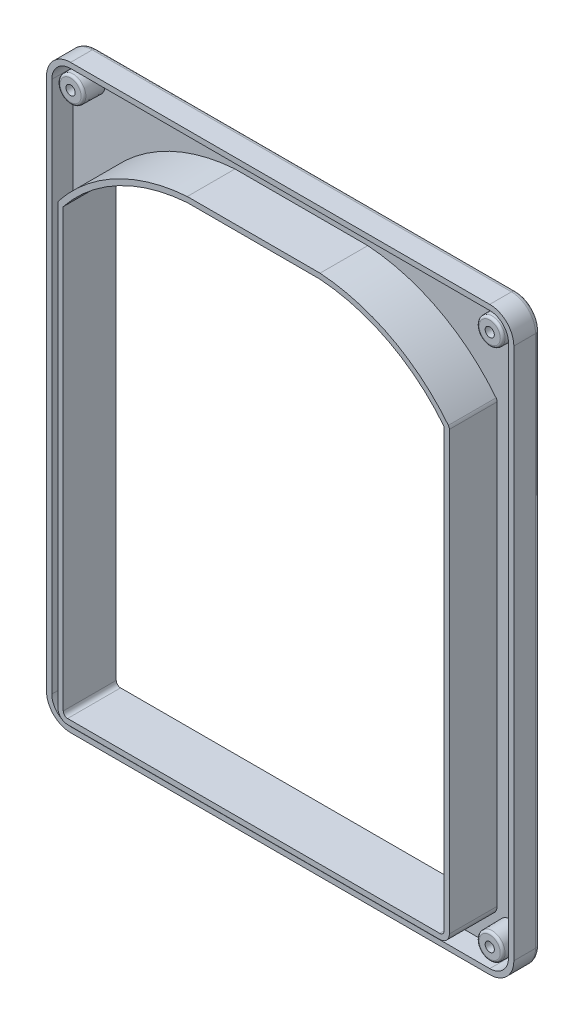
ISO-10303-21;
HEADER;
FILE_DESCRIPTION(('STEP AP214'),'2;1');
FILE_NAME('part.step','',(''),(''),'','','');
FILE_SCHEMA(('AUTOMOTIVE_DESIGN { 1 0 10303 214 1 1 1 1 }'));
ENDSEC;
DATA;
#1=APPLICATION_CONTEXT('core data for automotive mechanical design processes');
#2=APPLICATION_PROTOCOL_DEFINITION('international standard','automotive_design',2000,#1);
#3=PRODUCT_CONTEXT('',#1,'mechanical');
#4=PRODUCT('Part','Part','',(#3));
#5=PRODUCT_RELATED_PRODUCT_CATEGORY('part','',(#4));
#6=PRODUCT_DEFINITION_FORMATION('','',#4);
#7=PRODUCT_DEFINITION_CONTEXT('part definition',#1,'design');
#8=PRODUCT_DEFINITION('design','',#6,#7);
#9=PRODUCT_DEFINITION_SHAPE('','',#8);
#10=(LENGTH_UNIT() NAMED_UNIT(*) SI_UNIT(.MILLI.,.METRE.));
#11=(NAMED_UNIT(*) PLANE_ANGLE_UNIT() SI_UNIT($,.RADIAN.));
#12=(NAMED_UNIT(*) SI_UNIT($,.STERADIAN.) SOLID_ANGLE_UNIT());
#13=UNCERTAINTY_MEASURE_WITH_UNIT(LENGTH_MEASURE(1.E-05),#10,'distance_accuracy_value','');
#14=(GEOMETRIC_REPRESENTATION_CONTEXT(3) GLOBAL_UNCERTAINTY_ASSIGNED_CONTEXT((#13)) GLOBAL_UNIT_ASSIGNED_CONTEXT((#10,
#11,#12)) REPRESENTATION_CONTEXT('',''));
#15=CARTESIAN_POINT('',(0.,0.,0.));
#16=DIRECTION('',(0.,0.,1.));
#17=DIRECTION('',(1.,0.,0.));
#18=AXIS2_PLACEMENT_3D('',#15,#16,#17);
#19=CARTESIAN_POINT('',(87.,-110.65,2.2));
#20=DIRECTION('',(0.,0.,1.));
#21=DIRECTION('',(1.,0.,0.));
#22=AXIS2_PLACEMENT_3D('',#19,#20,#21);
#23=PLANE('',#22);
#24=CARTESIAN_POINT('',(-87.,-110.65,2.2));
#25=DIRECTION('',(0.,0.,1.));
#26=DIRECTION('',(1.,0.,0.));
#27=AXIS2_PLACEMENT_3D('',#24,#25,#26);
#28=CIRCLE('',#27,5.5);
#29=CARTESIAN_POINT('',(-81.5,-110.65,2.2));
#30=VERTEX_POINT('',#29);
#31=EDGE_CURVE('E850',#30,#30,#28,.T.);
#32=ORIENTED_EDGE('',*,*,#31,.F.);
#33=EDGE_LOOP('',(#32));
#34=FACE_BOUND('',#33,.T.);
#35=CARTESIAN_POINT('',(87.,110.35,2.2));
#36=DIRECTION('',(0.,0.,1.));
#37=DIRECTION('',(1.,0.,0.));
#38=AXIS2_PLACEMENT_3D('',#35,#36,#37);
#39=CIRCLE('',#38,5.5);
#40=CARTESIAN_POINT('',(92.5,110.35,2.2));
#41=VERTEX_POINT('',#40);
#42=EDGE_CURVE('E864',#41,#41,#39,.T.);
#43=ORIENTED_EDGE('',*,*,#42,.F.);
#44=EDGE_LOOP('',(#43));
#45=FACE_BOUND('',#44,.T.);
#46=CARTESIAN_POINT('',(87.,-110.65,2.2));
#47=DIRECTION('',(0.,0.,1.));
#48=DIRECTION('',(1.,0.,0.));
#49=AXIS2_PLACEMENT_3D('',#46,#47,#48);
#50=CIRCLE('',#49,7.79999999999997);
#51=CARTESIAN_POINT('',(87.,-118.45,2.2));
#52=VERTEX_POINT('',#51);
#53=CARTESIAN_POINT('',(94.8,-110.65,2.2));
#54=VERTEX_POINT('',#53);
#55=EDGE_CURVE('E891',#52,#54,#50,.T.);
#56=ORIENTED_EDGE('',*,*,#55,.T.);
#57=DIRECTION('',(0.,1.,0.));
#58=VECTOR('',#57,1.);
#59=CARTESIAN_POINT('',(94.8,-110.65,2.2));
#60=LINE('',#59,#58);
#61=CARTESIAN_POINT('',(94.8,110.35,2.2));
#62=VERTEX_POINT('',#61);
#63=EDGE_CURVE('E893',#54,#62,#60,.T.);
#64=ORIENTED_EDGE('',*,*,#63,.T.);
#65=CARTESIAN_POINT('',(87.,110.35,2.2));
#66=DIRECTION('',(0.,0.,1.));
#67=DIRECTION('',(1.,0.,0.));
#68=AXIS2_PLACEMENT_3D('',#65,#66,#67);
#69=CIRCLE('',#68,7.79999999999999);
#70=CARTESIAN_POINT('',(86.9999999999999,118.15,2.2));
#71=VERTEX_POINT('',#70);
#72=EDGE_CURVE('E895',#62,#71,#69,.T.);
#73=ORIENTED_EDGE('',*,*,#72,.T.);
#74=DIRECTION('',(-1.,0.,0.));
#75=VECTOR('',#74,1.);
#76=CARTESIAN_POINT('',(86.9999999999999,118.15,2.2));
#77=LINE('',#76,#75);
#78=CARTESIAN_POINT('',(-87.,118.15,2.2));
#79=VERTEX_POINT('',#78);
#80=EDGE_CURVE('E897',#71,#79,#77,.T.);
#81=ORIENTED_EDGE('',*,*,#80,.T.);
#82=CARTESIAN_POINT('',(-87.,110.35,2.2));
#83=DIRECTION('',(0.,0.,1.));
#84=DIRECTION('',(1.,0.,0.));
#85=AXIS2_PLACEMENT_3D('',#82,#83,#84);
#86=CIRCLE('',#85,7.79999999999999);
#87=CARTESIAN_POINT('',(-94.8,110.35,2.2));
#88=VERTEX_POINT('',#87);
#89=EDGE_CURVE('E899',#79,#88,#86,.T.);
#90=ORIENTED_EDGE('',*,*,#89,.T.);
#91=DIRECTION('',(0.,-1.,0.));
#92=VECTOR('',#91,1.);
#93=CARTESIAN_POINT('',(-94.8,110.35,2.2));
#94=LINE('',#93,#92);
#95=CARTESIAN_POINT('',(-94.8,-110.65,2.2));
#96=VERTEX_POINT('',#95);
#97=EDGE_CURVE('E329',#88,#96,#94,.T.);
#98=ORIENTED_EDGE('',*,*,#97,.T.);
#99=CARTESIAN_POINT('',(-87.,-110.65,2.2));
#100=DIRECTION('',(0.,0.,1.));
#101=DIRECTION('',(1.,0.,0.));
#102=AXIS2_PLACEMENT_3D('',#99,#100,#101);
#103=CIRCLE('',#102,7.79999999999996);
#104=CARTESIAN_POINT('',(-87.,-118.45,2.2));
#105=VERTEX_POINT('',#104);
#106=EDGE_CURVE('E322',#96,#105,#103,.T.);
#107=ORIENTED_EDGE('',*,*,#106,.T.);
#108=DIRECTION('',(1.,0.,0.));
#109=VECTOR('',#108,1.);
#110=CARTESIAN_POINT('',(-87.,-118.45,2.2));
#111=LINE('',#110,#109);
#112=EDGE_CURVE('E326',#105,#52,#111,.T.);
#113=ORIENTED_EDGE('',*,*,#112,.T.);
#114=EDGE_LOOP('',(#56,#64,#73,#81,#90,#98,#107,#113));
#115=FACE_BOUND('',#114,.T.);
#116=CARTESIAN_POINT('',(-79.25,78.0298143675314,2.2));
#117=DIRECTION('',(0.,0.,1.));
#118=DIRECTION('',(1.,0.,0.));
#119=AXIS2_PLACEMENT_3D('',#116,#117,#118);
#120=CIRCLE('',#119,2.00000000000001);
#121=CARTESIAN_POINT('',(-80.8174310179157,79.2720542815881,2.2));
#122=VERTEX_POINT('',#121);
#123=CARTESIAN_POINT('',(-81.25,78.0298143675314,2.2));
#124=VERTEX_POINT('',#123);
#125=EDGE_CURVE('E454',#122,#124,#120,.T.);
#126=ORIENTED_EDGE('',*,*,#125,.F.);
#127=CARTESIAN_POINT('',(-22.3628428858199,32.9448974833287,2.2));
#128=DIRECTION('',(0.,0.,1.));
#129=DIRECTION('',(1.,0.,0.));
#130=AXIS2_PLACEMENT_3D('',#127,#128,#129);
#131=CIRCLE('',#130,74.5864889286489);
#132=CARTESIAN_POINT('',(-27.5614052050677,107.35,2.2));
#133=VERTEX_POINT('',#132);
#134=EDGE_CURVE('E427',#133,#122,#131,.T.);
#135=ORIENTED_EDGE('',*,*,#134,.F.);
#136=DIRECTION('',(-1.,0.,0.));
#137=VECTOR('',#136,1.);
#138=CARTESIAN_POINT('',(-27.5614052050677,107.35,2.2));
#139=LINE('',#138,#137);
#140=CARTESIAN_POINT('',(27.5614052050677,107.35,2.2));
#141=VERTEX_POINT('',#140);
#142=EDGE_CURVE('E430',#141,#133,#139,.T.);
#143=ORIENTED_EDGE('',*,*,#142,.F.);
#144=CARTESIAN_POINT('',(22.3628428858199,32.9448974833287,2.2));
#145=DIRECTION('',(0.,0.,1.));
#146=DIRECTION('',(1.,0.,0.));
#147=AXIS2_PLACEMENT_3D('',#144,#145,#146);
#148=CIRCLE('',#147,74.5864889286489);
#149=CARTESIAN_POINT('',(80.8174310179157,79.2720542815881,2.2));
#150=VERTEX_POINT('',#149);
#151=EDGE_CURVE('E433',#150,#141,#148,.T.);
#152=ORIENTED_EDGE('',*,*,#151,.F.);
#153=CARTESIAN_POINT('',(79.25,78.0298143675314,2.2));
#154=DIRECTION('',(0.,0.,1.));
#155=DIRECTION('',(1.,0.,0.));
#156=AXIS2_PLACEMENT_3D('',#153,#154,#155);
#157=CIRCLE('',#156,2.00000000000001);
#158=CARTESIAN_POINT('',(81.25,78.0298143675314,2.2));
#159=VERTEX_POINT('',#158);
#160=EDGE_CURVE('E436',#159,#150,#157,.T.);
#161=ORIENTED_EDGE('',*,*,#160,.F.);
#162=DIRECTION('',(0.,1.,0.));
#163=VECTOR('',#162,1.);
#164=CARTESIAN_POINT('',(81.25,-103.35,2.2));
#165=LINE('',#164,#163);
#166=CARTESIAN_POINT('',(81.25,-103.35,2.2));
#167=VERTEX_POINT('',#166);
#168=EDGE_CURVE('E439',#167,#159,#165,.T.);
#169=ORIENTED_EDGE('',*,*,#168,.F.);
#170=CARTESIAN_POINT('',(77.25,-103.35,2.2));
#171=DIRECTION('',(0.,0.,1.));
#172=DIRECTION('',(1.,0.,0.));
#173=AXIS2_PLACEMENT_3D('',#170,#171,#172);
#174=CIRCLE('',#173,4.);
#175=CARTESIAN_POINT('',(77.25,-107.35,2.2));
#176=VERTEX_POINT('',#175);
#177=EDGE_CURVE('E442',#176,#167,#174,.T.);
#178=ORIENTED_EDGE('',*,*,#177,.F.);
#179=DIRECTION('',(1.,0.,0.));
#180=VECTOR('',#179,1.);
#181=CARTESIAN_POINT('',(-77.25,-107.35,2.2));
#182=LINE('',#181,#180);
#183=CARTESIAN_POINT('',(-77.25,-107.35,2.2));
#184=VERTEX_POINT('',#183);
#185=EDGE_CURVE('E445',#184,#176,#182,.T.);
#186=ORIENTED_EDGE('',*,*,#185,.F.);
#187=CARTESIAN_POINT('',(-77.25,-103.35,2.2));
#188=DIRECTION('',(0.,0.,1.));
#189=DIRECTION('',(1.,0.,0.));
#190=AXIS2_PLACEMENT_3D('',#187,#188,#189);
#191=CIRCLE('',#190,4.);
#192=CARTESIAN_POINT('',(-81.25,-103.35,2.2));
#193=VERTEX_POINT('',#192);
#194=EDGE_CURVE('E448',#193,#184,#191,.T.);
#195=ORIENTED_EDGE('',*,*,#194,.F.);
#196=DIRECTION('',(0.,-1.,0.));
#197=VECTOR('',#196,1.);
#198=CARTESIAN_POINT('',(-81.25,-103.35,2.2));
#199=LINE('',#198,#197);
#200=EDGE_CURVE('E451',#124,#193,#199,.T.);
#201=ORIENTED_EDGE('',*,*,#200,.F.);
#202=EDGE_LOOP('',(#126,#135,#143,#152,#161,#169,#178,#186,#195,#201));
#203=FACE_BOUND('',#202,.T.);
#204=CARTESIAN_POINT('',(-87.,110.35,2.2));
#205=DIRECTION('',(0.,0.,1.));
#206=DIRECTION('',(1.,0.,0.));
#207=AXIS2_PLACEMENT_3D('',#204,#205,#206);
#208=CIRCLE('',#207,5.5);
#209=CARTESIAN_POINT('',(-81.5,110.35,2.2));
#210=VERTEX_POINT('',#209);
#211=EDGE_CURVE('E829',#210,#210,#208,.T.);
#212=ORIENTED_EDGE('',*,*,#211,.F.);
#213=EDGE_LOOP('',(#212));
#214=FACE_BOUND('',#213,.T.);
#215=CARTESIAN_POINT('',(87.,-110.65,2.2));
#216=DIRECTION('',(0.,0.,1.));
#217=DIRECTION('',(1.,0.,0.));
#218=AXIS2_PLACEMENT_3D('',#215,#216,#217);
#219=CIRCLE('',#218,5.5);
#220=CARTESIAN_POINT('',(92.5,-110.65,2.2));
#221=VERTEX_POINT('',#220);
#222=EDGE_CURVE('E832',#221,#221,#219,.T.);
#223=ORIENTED_EDGE('',*,*,#222,.F.);
#224=EDGE_LOOP('',(#223));
#225=FACE_BOUND('',#224,.T.);
#226=ADVANCED_FACE('F77',(#34,#45,#115,#203,#214,#225),#23,.T.);
#227=CARTESIAN_POINT('',(-79.25,78.0298143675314,22.));
#228=DIRECTION('',(0.,0.,-1.));
#229=DIRECTION('',(-1.,0.,0.));
#230=AXIS2_PLACEMENT_3D('',#227,#228,#229);
#231=PLANE('',#230);
#232=CARTESIAN_POINT('',(-79.25,78.0298143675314,22.));
#233=DIRECTION('',(0.,0.,1.));
#234=DIRECTION('',(-1.,0.,0.));
#235=AXIS2_PLACEMENT_3D('',#232,#233,#234);
#236=CIRCLE('',#235,2.00000000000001);
#237=CARTESIAN_POINT('',(-80.8174310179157,79.2720542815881,22.));
#238=VERTEX_POINT('',#237);
#239=CARTESIAN_POINT('',(-81.25,78.0298143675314,22.));
#240=VERTEX_POINT('',#239);
#241=EDGE_CURVE('E514',#238,#240,#236,.T.);
#242=ORIENTED_EDGE('',*,*,#241,.T.);
#243=DIRECTION('',(0.,-1.,0.));
#244=VECTOR('',#243,1.);
#245=CARTESIAN_POINT('',(-81.25,-103.35,22.));
#246=LINE('',#245,#244);
#247=CARTESIAN_POINT('',(-81.25,-103.35,22.));
#248=VERTEX_POINT('',#247);
#249=EDGE_CURVE('E517',#240,#248,#246,.T.);
#250=ORIENTED_EDGE('',*,*,#249,.T.);
#251=CARTESIAN_POINT('',(-77.25,-103.35,22.));
#252=DIRECTION('',(0.,0.,1.));
#253=DIRECTION('',(1.,0.,0.));
#254=AXIS2_PLACEMENT_3D('',#251,#252,#253);
#255=CIRCLE('',#254,4.);
#256=CARTESIAN_POINT('',(-77.25,-107.35,22.));
#257=VERTEX_POINT('',#256);
#258=EDGE_CURVE('E519',#248,#257,#255,.T.);
#259=ORIENTED_EDGE('',*,*,#258,.T.);
#260=DIRECTION('',(1.,0.,0.));
#261=VECTOR('',#260,1.);
#262=CARTESIAN_POINT('',(-77.25,-107.35,22.));
#263=LINE('',#262,#261);
#264=CARTESIAN_POINT('',(77.25,-107.35,22.));
#265=VERTEX_POINT('',#264);
#266=EDGE_CURVE('E521',#257,#265,#263,.T.);
#267=ORIENTED_EDGE('',*,*,#266,.T.);
#268=CARTESIAN_POINT('',(77.25,-103.35,22.));
#269=DIRECTION('',(0.,0.,1.));
#270=DIRECTION('',(-1.,0.,0.));
#271=AXIS2_PLACEMENT_3D('',#268,#269,#270);
#272=CIRCLE('',#271,4.);
#273=CARTESIAN_POINT('',(81.25,-103.35,22.));
#274=VERTEX_POINT('',#273);
#275=EDGE_CURVE('E523',#265,#274,#272,.T.);
#276=ORIENTED_EDGE('',*,*,#275,.T.);
#277=DIRECTION('',(0.,1.,0.));
#278=VECTOR('',#277,1.);
#279=CARTESIAN_POINT('',(81.25,-103.35,22.));
#280=LINE('',#279,#278);
#281=CARTESIAN_POINT('',(81.25,78.0298143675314,22.));
#282=VERTEX_POINT('',#281);
#283=EDGE_CURVE('E525',#274,#282,#280,.T.);
#284=ORIENTED_EDGE('',*,*,#283,.T.);
#285=CARTESIAN_POINT('',(79.25,78.0298143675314,22.));
#286=DIRECTION('',(0.,0.,1.));
#287=DIRECTION('',(1.,0.,0.));
#288=AXIS2_PLACEMENT_3D('',#285,#286,#287);
#289=CIRCLE('',#288,2.00000000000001);
#290=CARTESIAN_POINT('',(80.8174310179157,79.2720542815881,22.));
#291=VERTEX_POINT('',#290);
#292=EDGE_CURVE('E527',#282,#291,#289,.T.);
#293=ORIENTED_EDGE('',*,*,#292,.T.);
#294=CARTESIAN_POINT('',(22.3628428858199,32.9448974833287,22.));
#295=DIRECTION('',(0.,0.,1.));
#296=DIRECTION('',(1.,0.,0.));
#297=AXIS2_PLACEMENT_3D('',#294,#295,#296);
#298=CIRCLE('',#297,74.5864889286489);
#299=CARTESIAN_POINT('',(27.5614052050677,107.35,22.));
#300=VERTEX_POINT('',#299);
#301=EDGE_CURVE('E529',#291,#300,#298,.T.);
#302=ORIENTED_EDGE('',*,*,#301,.T.);
#303=DIRECTION('',(-1.,0.,0.));
#304=VECTOR('',#303,1.);
#305=CARTESIAN_POINT('',(-27.5614052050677,107.35,22.));
#306=LINE('',#305,#304);
#307=CARTESIAN_POINT('',(-27.5614052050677,107.35,22.));
#308=VERTEX_POINT('',#307);
#309=EDGE_CURVE('E531',#300,#308,#306,.T.);
#310=ORIENTED_EDGE('',*,*,#309,.T.);
#311=CARTESIAN_POINT('',(-22.3628428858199,32.9448974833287,22.));
#312=DIRECTION('',(0.,0.,1.));
#313=DIRECTION('',(-1.,0.,0.));
#314=AXIS2_PLACEMENT_3D('',#311,#312,#313);
#315=CIRCLE('',#314,74.5864889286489);
#316=EDGE_CURVE('E533',#308,#238,#315,.T.);
#317=ORIENTED_EDGE('',*,*,#316,.T.);
#318=EDGE_LOOP('',(#242,#250,#259,#267,#276,#284,#293,#302,#310,#317));
#319=FACE_BOUND('',#318,.T.);
#320=CARTESIAN_POINT('',(-77.25,-103.35,22.));
#321=DIRECTION('',(0.,0.,1.));
#322=DIRECTION('',(1.,0.,0.));
#323=AXIS2_PLACEMENT_3D('',#320,#321,#322);
#324=CIRCLE('',#323,1.80000000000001);
#325=CARTESIAN_POINT('',(-79.05,-103.35,22.));
#326=VERTEX_POINT('',#325);
#327=CARTESIAN_POINT('',(-77.25,-105.15,22.));
#328=VERTEX_POINT('',#327);
#329=EDGE_CURVE('E481',#326,#328,#324,.T.);
#330=ORIENTED_EDGE('',*,*,#329,.F.);
#331=DIRECTION('',(0.,-1.,0.));
#332=VECTOR('',#331,1.);
#333=CARTESIAN_POINT('',(-79.05,-103.35,22.));
#334=LINE('',#333,#332);
#335=CARTESIAN_POINT('',(-79.05,77.9601171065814,22.));
#336=VERTEX_POINT('',#335);
#337=EDGE_CURVE('E496',#336,#326,#334,.T.);
#338=ORIENTED_EDGE('',*,*,#337,.F.);
#339=CARTESIAN_POINT('',(-22.3628428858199,32.9448974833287,22.));
#340=DIRECTION('',(0.,0.,1.));
#341=DIRECTION('',(-1.,0.,0.));
#342=AXIS2_PLACEMENT_3D('',#339,#340,#341);
#343=CIRCLE('',#342,72.3864889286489);
#344=CARTESIAN_POINT('',(-27.4840683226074,105.15,22.));
#345=VERTEX_POINT('',#344);
#346=EDGE_CURVE('E493',#345,#336,#343,.T.);
#347=ORIENTED_EDGE('',*,*,#346,.F.);
#348=DIRECTION('',(-1.,0.,0.));
#349=VECTOR('',#348,1.);
#350=CARTESIAN_POINT('',(-27.4840683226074,105.15,22.));
#351=LINE('',#350,#349);
#352=CARTESIAN_POINT('',(27.4840683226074,105.15,22.));
#353=VERTEX_POINT('',#352);
#354=EDGE_CURVE('E491',#353,#345,#351,.T.);
#355=ORIENTED_EDGE('',*,*,#354,.F.);
#356=CARTESIAN_POINT('',(22.3628428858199,32.9448974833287,22.));
#357=DIRECTION('',(0.,0.,1.));
#358=DIRECTION('',(1.,0.,0.));
#359=AXIS2_PLACEMENT_3D('',#356,#357,#358);
#360=CIRCLE('',#359,72.3864889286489);
#361=CARTESIAN_POINT('',(79.05,77.9601171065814,22.));
#362=VERTEX_POINT('',#361);
#363=EDGE_CURVE('E489',#362,#353,#360,.T.);
#364=ORIENTED_EDGE('',*,*,#363,.F.);
#365=DIRECTION('',(0.,1.,0.));
#366=VECTOR('',#365,1.);
#367=CARTESIAN_POINT('',(79.05,-103.35,22.));
#368=LINE('',#367,#366);
#369=CARTESIAN_POINT('',(79.05,-103.35,22.));
#370=VERTEX_POINT('',#369);
#371=EDGE_CURVE('E487',#370,#362,#368,.T.);
#372=ORIENTED_EDGE('',*,*,#371,.F.);
#373=CARTESIAN_POINT('',(77.25,-103.35,22.));
#374=DIRECTION('',(0.,0.,1.));
#375=DIRECTION('',(-1.,0.,0.));
#376=AXIS2_PLACEMENT_3D('',#373,#374,#375);
#377=CIRCLE('',#376,1.80000000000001);
#378=CARTESIAN_POINT('',(77.25,-105.15,22.));
#379=VERTEX_POINT('',#378);
#380=EDGE_CURVE('E485',#379,#370,#377,.T.);
#381=ORIENTED_EDGE('',*,*,#380,.F.);
#382=DIRECTION('',(1.,0.,0.));
#383=VECTOR('',#382,1.);
#384=CARTESIAN_POINT('',(-77.25,-105.15,22.));
#385=LINE('',#384,#383);
#386=EDGE_CURVE('E483',#328,#379,#385,.T.);
#387=ORIENTED_EDGE('',*,*,#386,.F.);
#388=EDGE_LOOP('',(#330,#338,#347,#355,#364,#372,#381,#387));
#389=FACE_BOUND('',#388,.T.);
#390=ADVANCED_FACE('F661',(#319,#389),#231,.F.);
#391=CARTESIAN_POINT('',(-79.25,78.0298143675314,0.));
#392=DIRECTION('',(0.,0.,-1.));
#393=DIRECTION('',(-1.,0.,0.));
#394=AXIS2_PLACEMENT_3D('',#391,#392,#393);
#395=PLANE('',#394);
#396=CARTESIAN_POINT('',(-87.,110.35,0.));
#397=DIRECTION('',(0.,0.,-1.));
#398=DIRECTION('',(-1.,0.,0.));
#399=AXIS2_PLACEMENT_3D('',#396,#397,#398);
#400=CIRCLE('',#399,4.16634863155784);
#401=CARTESIAN_POINT('',(-91.1663486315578,110.35,0.));
#402=VERTEX_POINT('',#401);
#403=EDGE_CURVE('E633',#402,#402,#400,.F.);
#404=ORIENTED_EDGE('',*,*,#403,.T.);
#405=EDGE_LOOP('',(#404));
#406=FACE_BOUND('',#405,.T.);
#407=CARTESIAN_POINT('',(-87.,-110.65,0.));
#408=DIRECTION('',(0.,0.,-1.));
#409=DIRECTION('',(-1.,0.,0.));
#410=AXIS2_PLACEMENT_3D('',#407,#408,#409);
#411=CIRCLE('',#410,4.16634863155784);
#412=CARTESIAN_POINT('',(-91.1663486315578,-110.65,0.));
#413=VERTEX_POINT('',#412);
#414=EDGE_CURVE('E630',#413,#413,#411,.F.);
#415=ORIENTED_EDGE('',*,*,#414,.T.);
#416=EDGE_LOOP('',(#415));
#417=FACE_BOUND('',#416,.T.);
#418=CARTESIAN_POINT('',(87.,-110.65,0.));
#419=DIRECTION('',(0.,0.,-1.));
#420=DIRECTION('',(-1.,0.,0.));
#421=AXIS2_PLACEMENT_3D('',#418,#419,#420);
#422=CIRCLE('',#421,4.16634863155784);
#423=CARTESIAN_POINT('',(82.8336513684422,-110.65,0.));
#424=VERTEX_POINT('',#423);
#425=EDGE_CURVE('E627',#424,#424,#422,.F.);
#426=ORIENTED_EDGE('',*,*,#425,.T.);
#427=EDGE_LOOP('',(#426));
#428=FACE_BOUND('',#427,.T.);
#429=CARTESIAN_POINT('',(87.,110.35,0.));
#430=DIRECTION('',(0.,0.,-1.));
#431=DIRECTION('',(-1.,0.,0.));
#432=AXIS2_PLACEMENT_3D('',#429,#430,#431);
#433=CIRCLE('',#432,4.16634863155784);
#434=CARTESIAN_POINT('',(82.8336513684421,110.35,0.));
#435=VERTEX_POINT('',#434);
#436=EDGE_CURVE('E624',#435,#435,#433,.F.);
#437=ORIENTED_EDGE('',*,*,#436,.T.);
#438=EDGE_LOOP('',(#437));
#439=FACE_BOUND('',#438,.T.);
#440=DIRECTION('',(-1.,0.,0.));
#441=VECTOR('',#440,1.);
#442=CARTESIAN_POINT('',(86.9999999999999,118.35,0.));
#443=LINE('',#442,#441);
#444=CARTESIAN_POINT('',(-87.,118.35,0.));
#445=VERTEX_POINT('',#444);
#446=CARTESIAN_POINT('',(86.9999999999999,118.35,0.));
#447=VERTEX_POINT('',#446);
#448=EDGE_CURVE('E568',#445,#447,#443,.F.);
#449=ORIENTED_EDGE('',*,*,#448,.T.);
#450=CARTESIAN_POINT('',(87.,110.35,0.));
#451=DIRECTION('',(0.,0.,-1.));
#452=DIRECTION('',(-1.,0.,0.));
#453=AXIS2_PLACEMENT_3D('',#450,#451,#452);
#454=CIRCLE('',#453,7.99999999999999);
#455=CARTESIAN_POINT('',(95.,110.35,0.));
#456=VERTEX_POINT('',#455);
#457=EDGE_CURVE('E582',#447,#456,#454,.T.);
#458=ORIENTED_EDGE('',*,*,#457,.T.);
#459=DIRECTION('',(0.,1.,0.));
#460=VECTOR('',#459,1.);
#461=CARTESIAN_POINT('',(95.,-110.65,0.));
#462=LINE('',#461,#460);
#463=CARTESIAN_POINT('',(95.,-110.65,0.));
#464=VERTEX_POINT('',#463);
#465=EDGE_CURVE('E580',#456,#464,#462,.F.);
#466=ORIENTED_EDGE('',*,*,#465,.T.);
#467=CARTESIAN_POINT('',(87.,-110.65,0.));
#468=DIRECTION('',(0.,0.,-1.));
#469=DIRECTION('',(-1.,0.,0.));
#470=AXIS2_PLACEMENT_3D('',#467,#468,#469);
#471=CIRCLE('',#470,7.99999999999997);
#472=CARTESIAN_POINT('',(87.,-118.65,0.));
#473=VERTEX_POINT('',#472);
#474=EDGE_CURVE('E578',#464,#473,#471,.T.);
#475=ORIENTED_EDGE('',*,*,#474,.T.);
#476=DIRECTION('',(1.,0.,0.));
#477=VECTOR('',#476,1.);
#478=CARTESIAN_POINT('',(-87.,-118.65,0.));
#479=LINE('',#478,#477);
#480=CARTESIAN_POINT('',(-87.,-118.65,0.));
#481=VERTEX_POINT('',#480);
#482=EDGE_CURVE('E576',#473,#481,#479,.F.);
#483=ORIENTED_EDGE('',*,*,#482,.T.);
#484=CARTESIAN_POINT('',(-87.,-110.65,0.));
#485=DIRECTION('',(0.,0.,-1.));
#486=DIRECTION('',(-1.,0.,0.));
#487=AXIS2_PLACEMENT_3D('',#484,#485,#486);
#488=CIRCLE('',#487,7.99999999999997);
#489=CARTESIAN_POINT('',(-95.,-110.65,0.));
#490=VERTEX_POINT('',#489);
#491=EDGE_CURVE('E574',#481,#490,#488,.T.);
#492=ORIENTED_EDGE('',*,*,#491,.T.);
#493=DIRECTION('',(0.,-1.,0.));
#494=VECTOR('',#493,1.);
#495=CARTESIAN_POINT('',(-95.,110.35,0.));
#496=LINE('',#495,#494);
#497=CARTESIAN_POINT('',(-95.,110.35,0.));
#498=VERTEX_POINT('',#497);
#499=EDGE_CURVE('E572',#490,#498,#496,.F.);
#500=ORIENTED_EDGE('',*,*,#499,.T.);
#501=CARTESIAN_POINT('',(-87.,110.35,0.));
#502=DIRECTION('',(0.,0.,-1.));
#503=DIRECTION('',(-1.,0.,0.));
#504=AXIS2_PLACEMENT_3D('',#501,#502,#503);
#505=CIRCLE('',#504,8.);
#506=EDGE_CURVE('E570',#498,#445,#505,.T.);
#507=ORIENTED_EDGE('',*,*,#506,.T.);
#508=EDGE_LOOP('',(#449,#458,#466,#475,#483,#492,#500,#507));
#509=FACE_BOUND('',#508,.T.);
#510=DIRECTION('',(0.,-1.,0.));
#511=VECTOR('',#510,1.);
#512=CARTESIAN_POINT('',(-79.05,-103.35,0.));
#513=LINE('',#512,#511);
#514=CARTESIAN_POINT('',(-79.05,77.9601171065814,0.));
#515=VERTEX_POINT('',#514);
#516=CARTESIAN_POINT('',(-79.05,-103.35,0.));
#517=VERTEX_POINT('',#516);
#518=EDGE_CURVE('E478',#515,#517,#513,.T.);
#519=ORIENTED_EDGE('',*,*,#518,.T.);
#520=CARTESIAN_POINT('',(-77.25,-103.35,0.));
#521=DIRECTION('',(0.,0.,1.));
#522=DIRECTION('',(1.,0.,0.));
#523=AXIS2_PLACEMENT_3D('',#520,#521,#522);
#524=CIRCLE('',#523,1.80000000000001);
#525=CARTESIAN_POINT('',(-77.25,-105.15,0.));
#526=VERTEX_POINT('',#525);
#527=EDGE_CURVE('E457',#517,#526,#524,.T.);
#528=ORIENTED_EDGE('',*,*,#527,.T.);
#529=DIRECTION('',(1.,0.,0.));
#530=VECTOR('',#529,1.);
#531=CARTESIAN_POINT('',(-77.25,-105.15,0.));
#532=LINE('',#531,#530);
#533=CARTESIAN_POINT('',(77.25,-105.15,0.));
#534=VERTEX_POINT('',#533);
#535=EDGE_CURVE('E460',#526,#534,#532,.T.);
#536=ORIENTED_EDGE('',*,*,#535,.T.);
#537=CARTESIAN_POINT('',(77.25,-103.35,0.));
#538=DIRECTION('',(0.,0.,1.));
#539=DIRECTION('',(-1.,0.,0.));
#540=AXIS2_PLACEMENT_3D('',#537,#538,#539);
#541=CIRCLE('',#540,1.80000000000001);
#542=CARTESIAN_POINT('',(79.05,-103.35,0.));
#543=VERTEX_POINT('',#542);
#544=EDGE_CURVE('E463',#534,#543,#541,.T.);
#545=ORIENTED_EDGE('',*,*,#544,.T.);
#546=DIRECTION('',(0.,1.,0.));
#547=VECTOR('',#546,1.);
#548=CARTESIAN_POINT('',(79.05,-103.35,0.));
#549=LINE('',#548,#547);
#550=CARTESIAN_POINT('',(79.05,77.9601171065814,0.));
#551=VERTEX_POINT('',#550);
#552=EDGE_CURVE('E466',#543,#551,#549,.T.);
#553=ORIENTED_EDGE('',*,*,#552,.T.);
#554=CARTESIAN_POINT('',(22.3628428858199,32.9448974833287,0.));
#555=DIRECTION('',(0.,0.,1.));
#556=DIRECTION('',(1.,0.,0.));
#557=AXIS2_PLACEMENT_3D('',#554,#555,#556);
#558=CIRCLE('',#557,72.3864889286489);
#559=CARTESIAN_POINT('',(27.4840683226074,105.15,0.));
#560=VERTEX_POINT('',#559);
#561=EDGE_CURVE('E469',#551,#560,#558,.T.);
#562=ORIENTED_EDGE('',*,*,#561,.T.);
#563=DIRECTION('',(-1.,0.,0.));
#564=VECTOR('',#563,1.);
#565=CARTESIAN_POINT('',(-27.4840683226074,105.15,0.));
#566=LINE('',#565,#564);
#567=CARTESIAN_POINT('',(-27.4840683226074,105.15,0.));
#568=VERTEX_POINT('',#567);
#569=EDGE_CURVE('E472',#560,#568,#566,.T.);
#570=ORIENTED_EDGE('',*,*,#569,.T.);
#571=CARTESIAN_POINT('',(-22.3628428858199,32.9448974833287,0.));
#572=DIRECTION('',(0.,0.,1.));
#573=DIRECTION('',(-1.,0.,0.));
#574=AXIS2_PLACEMENT_3D('',#571,#572,#573);
#575=CIRCLE('',#574,72.3864889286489);
#576=EDGE_CURVE('E475',#568,#515,#575,.T.);
#577=ORIENTED_EDGE('',*,*,#576,.T.);
#578=EDGE_LOOP('',(#519,#528,#536,#545,#553,#562,#570,#577));
#579=FACE_BOUND('',#578,.T.);
#580=ADVANCED_FACE('F669',(#406,#417,#428,#439,#509,#579),#395,.T.);
#581=CARTESIAN_POINT('',(-79.25,78.0298143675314,22.));
#582=DIRECTION('',(0.,0.,-1.));
#583=DIRECTION('',(-1.,0.,0.));
#584=AXIS2_PLACEMENT_3D('',#581,#582,#583);
#585=CYLINDRICAL_SURFACE('',#584,2.00000000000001);
#586=DIRECTION('',(0.,0.,-1.));
#587=VECTOR('',#586,1.);
#588=CARTESIAN_POINT('',(-80.8174310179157,79.2720542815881,22.));
#589=LINE('',#588,#587);
#590=EDGE_CURVE('E535',#238,#122,#589,.T.);
#591=ORIENTED_EDGE('',*,*,#590,.T.);
#592=ORIENTED_EDGE('',*,*,#125,.T.);
#593=DIRECTION('',(0.,0.,-1.));
#594=VECTOR('',#593,1.);
#595=CARTESIAN_POINT('',(-81.25,78.0298143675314,22.));
#596=LINE('',#595,#594);
#597=EDGE_CURVE('E562',#240,#124,#596,.T.);
#598=ORIENTED_EDGE('',*,*,#597,.F.);
#599=ORIENTED_EDGE('',*,*,#241,.F.);
#600=EDGE_LOOP('',(#591,#592,#598,#599));
#601=FACE_BOUND('',#600,.T.);
#602=ADVANCED_FACE('F79',(#601),#585,.T.);
#603=CARTESIAN_POINT('',(-81.25,-103.35,22.));
#604=DIRECTION('',(1.,0.,0.));
#605=DIRECTION('',(0.,0.,-1.));
#606=AXIS2_PLACEMENT_3D('',#603,#604,#605);
#607=PLANE('',#606);
#608=ORIENTED_EDGE('',*,*,#597,.T.);
#609=ORIENTED_EDGE('',*,*,#200,.T.);
#610=DIRECTION('',(0.,0.,-1.));
#611=VECTOR('',#610,1.);
#612=CARTESIAN_POINT('',(-81.25,-103.35,22.));
#613=LINE('',#612,#611);
#614=EDGE_CURVE('E559',#248,#193,#613,.T.);
#615=ORIENTED_EDGE('',*,*,#614,.F.);
#616=ORIENTED_EDGE('',*,*,#249,.F.);
#617=EDGE_LOOP('',(#608,#609,#615,#616));
#618=FACE_BOUND('',#617,.T.);
#619=ADVANCED_FACE('F773',(#618),#607,.F.);
#620=CARTESIAN_POINT('',(-77.25,-103.35,22.));
#621=DIRECTION('',(0.,0.,-1.));
#622=DIRECTION('',(-1.,0.,0.));
#623=AXIS2_PLACEMENT_3D('',#620,#621,#622);
#624=CYLINDRICAL_SURFACE('',#623,4.);
#625=ORIENTED_EDGE('',*,*,#614,.T.);
#626=ORIENTED_EDGE('',*,*,#194,.T.);
#627=DIRECTION('',(0.,0.,-1.));
#628=VECTOR('',#627,1.);
#629=CARTESIAN_POINT('',(-77.25,-107.35,22.));
#630=LINE('',#629,#628);
#631=EDGE_CURVE('E556',#257,#184,#630,.T.);
#632=ORIENTED_EDGE('',*,*,#631,.F.);
#633=ORIENTED_EDGE('',*,*,#258,.F.);
#634=EDGE_LOOP('',(#625,#626,#632,#633));
#635=FACE_BOUND('',#634,.T.);
#636=ADVANCED_FACE('F770',(#635),#624,.T.);
#637=CARTESIAN_POINT('',(-77.25,-107.35,22.));
#638=DIRECTION('',(0.,1.,0.));
#639=DIRECTION('',(0.,0.,1.));
#640=AXIS2_PLACEMENT_3D('',#637,#638,#639);
#641=PLANE('',#640);
#642=ORIENTED_EDGE('',*,*,#631,.T.);
#643=ORIENTED_EDGE('',*,*,#185,.T.);
#644=DIRECTION('',(0.,0.,-1.));
#645=VECTOR('',#644,1.);
#646=CARTESIAN_POINT('',(77.25,-107.35,22.));
#647=LINE('',#646,#645);
#648=EDGE_CURVE('E553',#265,#176,#647,.T.);
#649=ORIENTED_EDGE('',*,*,#648,.F.);
#650=ORIENTED_EDGE('',*,*,#266,.F.);
#651=EDGE_LOOP('',(#642,#643,#649,#650));
#652=FACE_BOUND('',#651,.T.);
#653=ADVANCED_FACE('F766',(#652),#641,.F.);
#654=CARTESIAN_POINT('',(77.25,-103.35,22.));
#655=DIRECTION('',(0.,0.,-1.));
#656=DIRECTION('',(-1.,0.,0.));
#657=AXIS2_PLACEMENT_3D('',#654,#655,#656);
#658=CYLINDRICAL_SURFACE('',#657,4.);
#659=ORIENTED_EDGE('',*,*,#648,.T.);
#660=ORIENTED_EDGE('',*,*,#177,.T.);
#661=DIRECTION('',(0.,0.,-1.));
#662=VECTOR('',#661,1.);
#663=CARTESIAN_POINT('',(81.25,-103.35,22.));
#664=LINE('',#663,#662);
#665=EDGE_CURVE('E550',#274,#167,#664,.T.);
#666=ORIENTED_EDGE('',*,*,#665,.F.);
#667=ORIENTED_EDGE('',*,*,#275,.F.);
#668=EDGE_LOOP('',(#659,#660,#666,#667));
#669=FACE_BOUND('',#668,.T.);
#670=ADVANCED_FACE('F762',(#669),#658,.T.);
#671=CARTESIAN_POINT('',(81.25,-103.35,22.));
#672=DIRECTION('',(-1.,0.,0.));
#673=DIRECTION('',(0.,0.,1.));
#674=AXIS2_PLACEMENT_3D('',#671,#672,#673);
#675=PLANE('',#674);
#676=ORIENTED_EDGE('',*,*,#665,.T.);
#677=ORIENTED_EDGE('',*,*,#168,.T.);
#678=DIRECTION('',(0.,0.,-1.));
#679=VECTOR('',#678,1.);
#680=CARTESIAN_POINT('',(81.25,78.0298143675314,22.));
#681=LINE('',#680,#679);
#682=EDGE_CURVE('E547',#282,#159,#681,.T.);
#683=ORIENTED_EDGE('',*,*,#682,.F.);
#684=ORIENTED_EDGE('',*,*,#283,.F.);
#685=EDGE_LOOP('',(#676,#677,#683,#684));
#686=FACE_BOUND('',#685,.T.);
#687=ADVANCED_FACE('F758',(#686),#675,.F.);
#688=CARTESIAN_POINT('',(79.25,78.0298143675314,22.));
#689=DIRECTION('',(0.,0.,-1.));
#690=DIRECTION('',(-1.,0.,0.));
#691=AXIS2_PLACEMENT_3D('',#688,#689,#690);
#692=CYLINDRICAL_SURFACE('',#691,2.00000000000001);
#693=ORIENTED_EDGE('',*,*,#682,.T.);
#694=ORIENTED_EDGE('',*,*,#160,.T.);
#695=DIRECTION('',(0.,0.,-1.));
#696=VECTOR('',#695,1.);
#697=CARTESIAN_POINT('',(80.8174310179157,79.2720542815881,22.));
#698=LINE('',#697,#696);
#699=EDGE_CURVE('E544',#291,#150,#698,.T.);
#700=ORIENTED_EDGE('',*,*,#699,.F.);
#701=ORIENTED_EDGE('',*,*,#292,.F.);
#702=EDGE_LOOP('',(#693,#694,#700,#701));
#703=FACE_BOUND('',#702,.T.);
#704=ADVANCED_FACE('F754',(#703),#692,.T.);
#705=CARTESIAN_POINT('',(22.3628428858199,32.9448974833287,22.));
#706=DIRECTION('',(0.,0.,-1.));
#707=DIRECTION('',(-1.,0.,0.));
#708=AXIS2_PLACEMENT_3D('',#705,#706,#707);
#709=CYLINDRICAL_SURFACE('',#708,74.5864889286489);
#710=ORIENTED_EDGE('',*,*,#699,.T.);
#711=ORIENTED_EDGE('',*,*,#151,.T.);
#712=DIRECTION('',(0.,0.,-1.));
#713=VECTOR('',#712,1.);
#714=CARTESIAN_POINT('',(27.5614052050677,107.35,22.));
#715=LINE('',#714,#713);
#716=EDGE_CURVE('E541',#300,#141,#715,.T.);
#717=ORIENTED_EDGE('',*,*,#716,.F.);
#718=ORIENTED_EDGE('',*,*,#301,.F.);
#719=EDGE_LOOP('',(#710,#711,#717,#718));
#720=FACE_BOUND('',#719,.T.);
#721=ADVANCED_FACE('F750',(#720),#709,.T.);
#722=CARTESIAN_POINT('',(-27.5614052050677,107.35,22.));
#723=DIRECTION('',(0.,-1.,0.));
#724=DIRECTION('',(0.,0.,-1.));
#725=AXIS2_PLACEMENT_3D('',#722,#723,#724);
#726=PLANE('',#725);
#727=ORIENTED_EDGE('',*,*,#716,.T.);
#728=ORIENTED_EDGE('',*,*,#142,.T.);
#729=DIRECTION('',(0.,0.,-1.));
#730=VECTOR('',#729,1.);
#731=CARTESIAN_POINT('',(-27.5614052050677,107.35,22.));
#732=LINE('',#731,#730);
#733=EDGE_CURVE('E538',#308,#133,#732,.T.);
#734=ORIENTED_EDGE('',*,*,#733,.F.);
#735=ORIENTED_EDGE('',*,*,#309,.F.);
#736=EDGE_LOOP('',(#727,#728,#734,#735));
#737=FACE_BOUND('',#736,.T.);
#738=ADVANCED_FACE('F746',(#737),#726,.F.);
#739=CARTESIAN_POINT('',(-22.3628428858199,32.9448974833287,22.));
#740=DIRECTION('',(0.,0.,-1.));
#741=DIRECTION('',(-1.,0.,0.));
#742=AXIS2_PLACEMENT_3D('',#739,#740,#741);
#743=CYLINDRICAL_SURFACE('',#742,74.5864889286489);
#744=ORIENTED_EDGE('',*,*,#733,.T.);
#745=ORIENTED_EDGE('',*,*,#134,.T.);
#746=ORIENTED_EDGE('',*,*,#590,.F.);
#747=ORIENTED_EDGE('',*,*,#316,.F.);
#748=EDGE_LOOP('',(#744,#745,#746,#747));
#749=FACE_BOUND('',#748,.T.);
#750=ADVANCED_FACE('F739',(#749),#743,.T.);
#751=CARTESIAN_POINT('',(-77.25,-103.35,22.));
#752=DIRECTION('',(0.,0.,-1.));
#753=DIRECTION('',(-1.,0.,0.));
#754=AXIS2_PLACEMENT_3D('',#751,#752,#753);
#755=CYLINDRICAL_SURFACE('',#754,1.80000000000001);
#756=DIRECTION('',(0.,0.,-1.));
#757=VECTOR('',#756,1.);
#758=CARTESIAN_POINT('',(-77.25,-105.15,22.));
#759=LINE('',#758,#757);
#760=EDGE_CURVE('E512',#328,#526,#759,.T.);
#761=ORIENTED_EDGE('',*,*,#760,.T.);
#762=ORIENTED_EDGE('',*,*,#527,.F.);
#763=DIRECTION('',(0.,0.,-1.));
#764=VECTOR('',#763,1.);
#765=CARTESIAN_POINT('',(-79.05,-103.35,22.));
#766=LINE('',#765,#764);
#767=EDGE_CURVE('E498',#326,#517,#766,.T.);
#768=ORIENTED_EDGE('',*,*,#767,.F.);
#769=ORIENTED_EDGE('',*,*,#329,.T.);
#770=EDGE_LOOP('',(#761,#762,#768,#769));
#771=FACE_BOUND('',#770,.T.);
#772=ADVANCED_FACE('F735',(#771),#755,.F.);
#773=CARTESIAN_POINT('',(-77.25,-105.15,22.));
#774=DIRECTION('',(0.,1.,0.));
#775=DIRECTION('',(0.,0.,1.));
#776=AXIS2_PLACEMENT_3D('',#773,#774,#775);
#777=PLANE('',#776);
#778=DIRECTION('',(0.,0.,-1.));
#779=VECTOR('',#778,1.);
#780=CARTESIAN_POINT('',(77.25,-105.15,22.));
#781=LINE('',#780,#779);
#782=EDGE_CURVE('E510',#379,#534,#781,.T.);
#783=ORIENTED_EDGE('',*,*,#782,.T.);
#784=ORIENTED_EDGE('',*,*,#535,.F.);
#785=ORIENTED_EDGE('',*,*,#760,.F.);
#786=ORIENTED_EDGE('',*,*,#386,.T.);
#787=EDGE_LOOP('',(#783,#784,#785,#786));
#788=FACE_BOUND('',#787,.T.);
#789=ADVANCED_FACE('F731',(#788),#777,.T.);
#790=CARTESIAN_POINT('',(77.25,-103.35,22.));
#791=DIRECTION('',(0.,0.,-1.));
#792=DIRECTION('',(-1.,0.,0.));
#793=AXIS2_PLACEMENT_3D('',#790,#791,#792);
#794=CYLINDRICAL_SURFACE('',#793,1.80000000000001);
#795=DIRECTION('',(0.,0.,-1.));
#796=VECTOR('',#795,1.);
#797=CARTESIAN_POINT('',(79.05,-103.35,22.));
#798=LINE('',#797,#796);
#799=EDGE_CURVE('E508',#370,#543,#798,.T.);
#800=ORIENTED_EDGE('',*,*,#799,.T.);
#801=ORIENTED_EDGE('',*,*,#544,.F.);
#802=ORIENTED_EDGE('',*,*,#782,.F.);
#803=ORIENTED_EDGE('',*,*,#380,.T.);
#804=EDGE_LOOP('',(#800,#801,#802,#803));
#805=FACE_BOUND('',#804,.T.);
#806=ADVANCED_FACE('F727',(#805),#794,.F.);
#807=CARTESIAN_POINT('',(79.05,-103.35,22.));
#808=DIRECTION('',(-1.,0.,0.));
#809=DIRECTION('',(0.,0.,1.));
#810=AXIS2_PLACEMENT_3D('',#807,#808,#809);
#811=PLANE('',#810);
#812=DIRECTION('',(0.,0.,-1.));
#813=VECTOR('',#812,1.);
#814=CARTESIAN_POINT('',(79.05,77.9601171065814,22.));
#815=LINE('',#814,#813);
#816=EDGE_CURVE('E506',#362,#551,#815,.T.);
#817=ORIENTED_EDGE('',*,*,#816,.T.);
#818=ORIENTED_EDGE('',*,*,#552,.F.);
#819=ORIENTED_EDGE('',*,*,#799,.F.);
#820=ORIENTED_EDGE('',*,*,#371,.T.);
#821=EDGE_LOOP('',(#817,#818,#819,#820));
#822=FACE_BOUND('',#821,.T.);
#823=ADVANCED_FACE('F723',(#822),#811,.T.);
#824=CARTESIAN_POINT('',(22.3628428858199,32.9448974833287,22.));
#825=DIRECTION('',(0.,0.,-1.));
#826=DIRECTION('',(-1.,0.,0.));
#827=AXIS2_PLACEMENT_3D('',#824,#825,#826);
#828=CYLINDRICAL_SURFACE('',#827,72.3864889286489);
#829=DIRECTION('',(0.,0.,-1.));
#830=VECTOR('',#829,1.);
#831=CARTESIAN_POINT('',(27.4840683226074,105.15,22.));
#832=LINE('',#831,#830);
#833=EDGE_CURVE('E504',#353,#560,#832,.T.);
#834=ORIENTED_EDGE('',*,*,#833,.T.);
#835=ORIENTED_EDGE('',*,*,#561,.F.);
#836=ORIENTED_EDGE('',*,*,#816,.F.);
#837=ORIENTED_EDGE('',*,*,#363,.T.);
#838=EDGE_LOOP('',(#834,#835,#836,#837));
#839=FACE_BOUND('',#838,.T.);
#840=ADVANCED_FACE('F719',(#839),#828,.F.);
#841=CARTESIAN_POINT('',(-27.4840683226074,105.15,22.));
#842=DIRECTION('',(0.,-1.,0.));
#843=DIRECTION('',(0.,0.,-1.));
#844=AXIS2_PLACEMENT_3D('',#841,#842,#843);
#845=PLANE('',#844);
#846=DIRECTION('',(0.,0.,-1.));
#847=VECTOR('',#846,1.);
#848=CARTESIAN_POINT('',(-27.4840683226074,105.15,22.));
#849=LINE('',#848,#847);
#850=EDGE_CURVE('E502',#345,#568,#849,.T.);
#851=ORIENTED_EDGE('',*,*,#850,.T.);
#852=ORIENTED_EDGE('',*,*,#569,.F.);
#853=ORIENTED_EDGE('',*,*,#833,.F.);
#854=ORIENTED_EDGE('',*,*,#354,.T.);
#855=EDGE_LOOP('',(#851,#852,#853,#854));
#856=FACE_BOUND('',#855,.T.);
#857=ADVANCED_FACE('F715',(#856),#845,.T.);
#858=CARTESIAN_POINT('',(-22.3628428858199,32.9448974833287,22.));
#859=DIRECTION('',(0.,0.,-1.));
#860=DIRECTION('',(-1.,0.,0.));
#861=AXIS2_PLACEMENT_3D('',#858,#859,#860);
#862=CYLINDRICAL_SURFACE('',#861,72.3864889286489);
#863=DIRECTION('',(0.,0.,-1.));
#864=VECTOR('',#863,1.);
#865=CARTESIAN_POINT('',(-79.05,77.9601171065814,22.));
#866=LINE('',#865,#864);
#867=EDGE_CURVE('E500',#336,#515,#866,.T.);
#868=ORIENTED_EDGE('',*,*,#867,.T.);
#869=ORIENTED_EDGE('',*,*,#576,.F.);
#870=ORIENTED_EDGE('',*,*,#850,.F.);
#871=ORIENTED_EDGE('',*,*,#346,.T.);
#872=EDGE_LOOP('',(#868,#869,#870,#871));
#873=FACE_BOUND('',#872,.T.);
#874=ADVANCED_FACE('F711',(#873),#862,.F.);
#875=CARTESIAN_POINT('',(-79.05,-103.35,22.));
#876=DIRECTION('',(1.,0.,0.));
#877=DIRECTION('',(0.,0.,-1.));
#878=AXIS2_PLACEMENT_3D('',#875,#876,#877);
#879=PLANE('',#878);
#880=ORIENTED_EDGE('',*,*,#767,.T.);
#881=ORIENTED_EDGE('',*,*,#518,.F.);
#882=ORIENTED_EDGE('',*,*,#867,.F.);
#883=ORIENTED_EDGE('',*,*,#337,.T.);
#884=EDGE_LOOP('',(#880,#881,#882,#883));
#885=FACE_BOUND('',#884,.T.);
#886=ADVANCED_FACE('F707',(#885),#879,.T.);
#887=CARTESIAN_POINT('',(87.,-110.65,2.2));
#888=DIRECTION('',(0.,0.,-1.));
#889=DIRECTION('',(-1.,0.,0.));
#890=AXIS2_PLACEMENT_3D('',#887,#888,#889);
#891=CYLINDRICAL_SURFACE('',#890,9.99999999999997);
#892=DIRECTION('',(0.,0.,-1.));
#893=VECTOR('',#892,1.);
#894=CARTESIAN_POINT('',(87.,-120.65,2.2));
#895=LINE('',#894,#893);
#896=CARTESIAN_POINT('',(87.,-120.65,11.));
#897=VERTEX_POINT('',#896);
#898=CARTESIAN_POINT('',(87.,-120.65,2.));
#899=VERTEX_POINT('',#898);
#900=EDGE_CURVE('E406',#897,#899,#895,.T.);
#901=ORIENTED_EDGE('',*,*,#900,.T.);
#902=CARTESIAN_POINT('',(87.,-110.65,2.));
#903=DIRECTION('',(0.,0.,-1.));
#904=DIRECTION('',(-1.,0.,0.));
#905=AXIS2_PLACEMENT_3D('',#902,#903,#904);
#906=CIRCLE('',#905,9.99999999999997);
#907=CARTESIAN_POINT('',(97.,-110.65,2.));
#908=VERTEX_POINT('',#907);
#909=EDGE_CURVE('E587',#899,#908,#906,.F.);
#910=ORIENTED_EDGE('',*,*,#909,.T.);
#911=DIRECTION('',(0.,0.,-1.));
#912=VECTOR('',#911,1.);
#913=CARTESIAN_POINT('',(97.,-110.65,2.2));
#914=LINE('',#913,#912);
#915=CARTESIAN_POINT('',(97.,-110.65,11.));
#916=VERTEX_POINT('',#915);
#917=EDGE_CURVE('E424',#916,#908,#914,.T.);
#918=ORIENTED_EDGE('',*,*,#917,.F.);
#919=CARTESIAN_POINT('',(87.,-110.65,11.));
#920=DIRECTION('',(0.,0.,1.));
#921=DIRECTION('',(1.,0.,0.));
#922=AXIS2_PLACEMENT_3D('',#919,#920,#921);
#923=CIRCLE('',#922,9.99999999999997);
#924=EDGE_CURVE('E382',#897,#916,#923,.T.);
#925=ORIENTED_EDGE('',*,*,#924,.F.);
#926=EDGE_LOOP('',(#901,#910,#918,#925));
#927=FACE_BOUND('',#926,.T.);
#928=ADVANCED_FACE('F703',(#927),#891,.T.);
#929=CARTESIAN_POINT('',(97.,110.35,2.2));
#930=DIRECTION('',(-1.,0.,0.));
#931=DIRECTION('',(0.,-1.,0.));
#932=AXIS2_PLACEMENT_3D('',#929,#930,#931);
#933=PLANE('',#932);
#934=ORIENTED_EDGE('',*,*,#917,.T.);
#935=DIRECTION('',(0.,1.,0.));
#936=VECTOR('',#935,1.);
#937=CARTESIAN_POINT('',(97.,110.35,2.));
#938=LINE('',#937,#936);
#939=CARTESIAN_POINT('',(97.,110.35,2.));
#940=VERTEX_POINT('',#939);
#941=EDGE_CURVE('E585',#908,#940,#938,.T.);
#942=ORIENTED_EDGE('',*,*,#941,.T.);
#943=DIRECTION('',(0.,0.,-1.));
#944=VECTOR('',#943,1.);
#945=CARTESIAN_POINT('',(97.,110.35,2.2));
#946=LINE('',#945,#944);
#947=CARTESIAN_POINT('',(97.,110.35,11.));
#948=VERTEX_POINT('',#947);
#949=EDGE_CURVE('E421',#948,#940,#946,.T.);
#950=ORIENTED_EDGE('',*,*,#949,.F.);
#951=DIRECTION('',(0.,1.,0.));
#952=VECTOR('',#951,1.);
#953=CARTESIAN_POINT('',(97.,-110.65,11.));
#954=LINE('',#953,#952);
#955=EDGE_CURVE('E385',#916,#948,#954,.T.);
#956=ORIENTED_EDGE('',*,*,#955,.F.);
#957=EDGE_LOOP('',(#934,#942,#950,#956));
#958=FACE_BOUND('',#957,.T.);
#959=ADVANCED_FACE('F699',(#958),#933,.F.);
#960=CARTESIAN_POINT('',(87.,110.35,2.2));
#961=DIRECTION('',(0.,0.,-1.));
#962=DIRECTION('',(-1.,0.,0.));
#963=AXIS2_PLACEMENT_3D('',#960,#961,#962);
#964=CYLINDRICAL_SURFACE('',#963,9.99999999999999);
#965=ORIENTED_EDGE('',*,*,#949,.T.);
#966=CARTESIAN_POINT('',(87.,110.35,2.));
#967=DIRECTION('',(0.,0.,-1.));
#968=DIRECTION('',(-1.,0.,0.));
#969=AXIS2_PLACEMENT_3D('',#966,#967,#968);
#970=CIRCLE('',#969,9.99999999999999);
#971=CARTESIAN_POINT('',(86.9999999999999,120.35,2.));
#972=VERTEX_POINT('',#971);
#973=EDGE_CURVE('E565',#940,#972,#970,.F.);
#974=ORIENTED_EDGE('',*,*,#973,.T.);
#975=DIRECTION('',(0.,0.,-1.));
#976=VECTOR('',#975,1.);
#977=CARTESIAN_POINT('',(86.9999999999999,120.35,2.2));
#978=LINE('',#977,#976);
#979=CARTESIAN_POINT('',(86.9999999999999,120.35,11.));
#980=VERTEX_POINT('',#979);
#981=EDGE_CURVE('E419',#980,#972,#978,.T.);
#982=ORIENTED_EDGE('',*,*,#981,.F.);
#983=CARTESIAN_POINT('',(87.,110.35,11.));
#984=DIRECTION('',(0.,0.,1.));
#985=DIRECTION('',(1.,0.,0.));
#986=AXIS2_PLACEMENT_3D('',#983,#984,#985);
#987=CIRCLE('',#986,9.99999999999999);
#988=EDGE_CURVE('E388',#948,#980,#987,.T.);
#989=ORIENTED_EDGE('',*,*,#988,.F.);
#990=EDGE_LOOP('',(#965,#974,#982,#989));
#991=FACE_BOUND('',#990,.T.);
#992=ADVANCED_FACE('F696',(#991),#964,.T.);
#993=CARTESIAN_POINT('',(-87.,120.35,2.2));
#994=DIRECTION('',(0.,-1.,0.));
#995=DIRECTION('',(1.,0.,0.));
#996=AXIS2_PLACEMENT_3D('',#993,#994,#995);
#997=PLANE('',#996);
#998=ORIENTED_EDGE('',*,*,#981,.T.);
#999=DIRECTION('',(-1.,0.,0.));
#1000=VECTOR('',#999,1.);
#1001=CARTESIAN_POINT('',(-87.,120.35,2.));
#1002=LINE('',#1001,#1000);
#1003=CARTESIAN_POINT('',(-87.,120.35,2.));
#1004=VERTEX_POINT('',#1003);
#1005=EDGE_CURVE('E92',#972,#1004,#1002,.T.);
#1006=ORIENTED_EDGE('',*,*,#1005,.T.);
#1007=DIRECTION('',(0.,0.,-1.));
#1008=VECTOR('',#1007,1.);
#1009=CARTESIAN_POINT('',(-87.,120.35,2.2));
#1010=LINE('',#1009,#1008);
#1011=CARTESIAN_POINT('',(-87.,120.35,11.));
#1012=VERTEX_POINT('',#1011);
#1013=EDGE_CURVE('E417',#1012,#1004,#1010,.T.);
#1014=ORIENTED_EDGE('',*,*,#1013,.F.);
#1015=DIRECTION('',(-1.,0.,0.));
#1016=VECTOR('',#1015,1.);
#1017=CARTESIAN_POINT('',(86.9999999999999,120.35,11.));
#1018=LINE('',#1017,#1016);
#1019=EDGE_CURVE('E391',#980,#1012,#1018,.T.);
#1020=ORIENTED_EDGE('',*,*,#1019,.F.);
#1021=EDGE_LOOP('',(#998,#1006,#1014,#1020));
#1022=FACE_BOUND('',#1021,.T.);
#1023=ADVANCED_FACE('F693',(#1022),#997,.F.);
#1024=CARTESIAN_POINT('',(-87.,110.35,2.2));
#1025=DIRECTION('',(0.,0.,-1.));
#1026=DIRECTION('',(-1.,0.,0.));
#1027=AXIS2_PLACEMENT_3D('',#1024,#1025,#1026);
#1028=CYLINDRICAL_SURFACE('',#1027,10.);
#1029=ORIENTED_EDGE('',*,*,#1013,.T.);
#1030=CARTESIAN_POINT('',(-87.,110.35,2.));
#1031=DIRECTION('',(0.,0.,-1.));
#1032=DIRECTION('',(-1.,0.,0.));
#1033=AXIS2_PLACEMENT_3D('',#1030,#1031,#1032);
#1034=CIRCLE('',#1033,10.);
#1035=CARTESIAN_POINT('',(-97.,110.35,2.));
#1036=VERTEX_POINT('',#1035);
#1037=EDGE_CURVE('E99',#1004,#1036,#1034,.F.);
#1038=ORIENTED_EDGE('',*,*,#1037,.T.);
#1039=DIRECTION('',(0.,0.,-1.));
#1040=VECTOR('',#1039,1.);
#1041=CARTESIAN_POINT('',(-97.,110.35,2.2));
#1042=LINE('',#1041,#1040);
#1043=CARTESIAN_POINT('',(-97.,110.35,11.));
#1044=VERTEX_POINT('',#1043);
#1045=EDGE_CURVE('E415',#1044,#1036,#1042,.T.);
#1046=ORIENTED_EDGE('',*,*,#1045,.F.);
#1047=CARTESIAN_POINT('',(-87.,110.35,11.));
#1048=DIRECTION('',(0.,0.,1.));
#1049=DIRECTION('',(1.,0.,0.));
#1050=AXIS2_PLACEMENT_3D('',#1047,#1048,#1049);
#1051=CIRCLE('',#1050,9.99999999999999);
#1052=EDGE_CURVE('E394',#1012,#1044,#1051,.T.);
#1053=ORIENTED_EDGE('',*,*,#1052,.F.);
#1054=EDGE_LOOP('',(#1029,#1038,#1046,#1053));
#1055=FACE_BOUND('',#1054,.T.);
#1056=ADVANCED_FACE('F689',(#1055),#1028,.T.);
#1057=CARTESIAN_POINT('',(-97.,110.35,2.2));
#1058=DIRECTION('',(1.,0.,0.));
#1059=DIRECTION('',(0.,1.,0.));
#1060=AXIS2_PLACEMENT_3D('',#1057,#1058,#1059);
#1061=PLANE('',#1060);
#1062=ORIENTED_EDGE('',*,*,#1045,.T.);
#1063=DIRECTION('',(0.,-1.,0.));
#1064=VECTOR('',#1063,1.);
#1065=CARTESIAN_POINT('',(-97.,-110.65,2.));
#1066=LINE('',#1065,#1064);
#1067=CARTESIAN_POINT('',(-97.,-110.65,2.));
#1068=VERTEX_POINT('',#1067);
#1069=EDGE_CURVE('E593',#1036,#1068,#1066,.T.);
#1070=ORIENTED_EDGE('',*,*,#1069,.T.);
#1071=DIRECTION('',(0.,0.,-1.));
#1072=VECTOR('',#1071,1.);
#1073=CARTESIAN_POINT('',(-97.,-110.65,2.2));
#1074=LINE('',#1073,#1072);
#1075=CARTESIAN_POINT('',(-96.9999999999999,-110.65,11.));
#1076=VERTEX_POINT('',#1075);
#1077=EDGE_CURVE('E412',#1076,#1068,#1074,.T.);
#1078=ORIENTED_EDGE('',*,*,#1077,.F.);
#1079=DIRECTION('',(0.,-1.,0.));
#1080=VECTOR('',#1079,1.);
#1081=CARTESIAN_POINT('',(-97.,110.35,11.));
#1082=LINE('',#1081,#1080);
#1083=EDGE_CURVE('E397',#1044,#1076,#1082,.T.);
#1084=ORIENTED_EDGE('',*,*,#1083,.F.);
#1085=EDGE_LOOP('',(#1062,#1070,#1078,#1084));
#1086=FACE_BOUND('',#1085,.T.);
#1087=ADVANCED_FACE('F685',(#1086),#1061,.F.);
#1088=CARTESIAN_POINT('',(-87.,-110.65,2.2));
#1089=DIRECTION('',(0.,0.,-1.));
#1090=DIRECTION('',(-1.,0.,0.));
#1091=AXIS2_PLACEMENT_3D('',#1088,#1089,#1090);
#1092=CYLINDRICAL_SURFACE('',#1091,9.99999999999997);
#1093=ORIENTED_EDGE('',*,*,#1077,.T.);
#1094=CARTESIAN_POINT('',(-87.,-110.65,2.));
#1095=DIRECTION('',(0.,0.,-1.));
#1096=DIRECTION('',(-1.,0.,0.));
#1097=AXIS2_PLACEMENT_3D('',#1094,#1095,#1096);
#1098=CIRCLE('',#1097,9.99999999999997);
#1099=CARTESIAN_POINT('',(-87.,-120.65,2.));
#1100=VERTEX_POINT('',#1099);
#1101=EDGE_CURVE('E591',#1068,#1100,#1098,.F.);
#1102=ORIENTED_EDGE('',*,*,#1101,.T.);
#1103=DIRECTION('',(0.,0.,-1.));
#1104=VECTOR('',#1103,1.);
#1105=CARTESIAN_POINT('',(-87.,-120.65,2.2));
#1106=LINE('',#1105,#1104);
#1107=CARTESIAN_POINT('',(-87.,-120.65,11.));
#1108=VERTEX_POINT('',#1107);
#1109=EDGE_CURVE('E409',#1108,#1100,#1106,.T.);
#1110=ORIENTED_EDGE('',*,*,#1109,.F.);
#1111=CARTESIAN_POINT('',(-87.,-110.65,11.));
#1112=DIRECTION('',(0.,0.,1.));
#1113=DIRECTION('',(1.,0.,0.));
#1114=AXIS2_PLACEMENT_3D('',#1111,#1112,#1113);
#1115=CIRCLE('',#1114,9.99999999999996);
#1116=EDGE_CURVE('E400',#1076,#1108,#1115,.T.);
#1117=ORIENTED_EDGE('',*,*,#1116,.F.);
#1118=EDGE_LOOP('',(#1093,#1102,#1110,#1117));
#1119=FACE_BOUND('',#1118,.T.);
#1120=ADVANCED_FACE('F681',(#1119),#1092,.T.);
#1121=CARTESIAN_POINT('',(-87.,-120.65,2.2));
#1122=DIRECTION('',(0.,1.,0.));
#1123=DIRECTION('',(-1.,0.,0.));
#1124=AXIS2_PLACEMENT_3D('',#1121,#1122,#1123);
#1125=PLANE('',#1124);
#1126=ORIENTED_EDGE('',*,*,#1109,.T.);
#1127=DIRECTION('',(1.,0.,0.));
#1128=VECTOR('',#1127,1.);
#1129=CARTESIAN_POINT('',(87.,-120.65,2.));
#1130=LINE('',#1129,#1128);
#1131=EDGE_CURVE('E589',#1100,#899,#1130,.T.);
#1132=ORIENTED_EDGE('',*,*,#1131,.T.);
#1133=ORIENTED_EDGE('',*,*,#900,.F.);
#1134=DIRECTION('',(1.,0.,0.));
#1135=VECTOR('',#1134,1.);
#1136=CARTESIAN_POINT('',(-87.,-120.65,11.));
#1137=LINE('',#1136,#1135);
#1138=EDGE_CURVE('E403',#1108,#897,#1137,.T.);
#1139=ORIENTED_EDGE('',*,*,#1138,.F.);
#1140=EDGE_LOOP('',(#1126,#1132,#1133,#1139));
#1141=FACE_BOUND('',#1140,.T.);
#1142=ADVANCED_FACE('F678',(#1141),#1125,.F.);
#1143=CARTESIAN_POINT('',(87.,110.35,2.2));
#1144=DIRECTION('',(0.,0.,-1.));
#1145=DIRECTION('',(-1.,0.,0.));
#1146=AXIS2_PLACEMENT_3D('',#1143,#1144,#1145);
#1147=CYLINDRICAL_SURFACE('',#1146,1.75);
#1148=CARTESIAN_POINT('',(87.,110.35,2.2));
#1149=DIRECTION('',(0.,0.,1.));
#1150=DIRECTION('',(1.,0.,0.));
#1151=AXIS2_PLACEMENT_3D('',#1148,#1149,#1150);
#1152=CIRCLE('',#1151,1.75);
#1153=CARTESIAN_POINT('',(88.75,110.35,2.2));
#1154=VERTEX_POINT('',#1153);
#1155=EDGE_CURVE('E861',#1154,#1154,#1152,.T.);
#1156=ORIENTED_EDGE('',*,*,#1155,.T.);
#1157=EDGE_LOOP('',(#1156));
#1158=FACE_BOUND('',#1157,.T.);
#1159=CARTESIAN_POINT('',(87.,110.35,0.));
#1160=DIRECTION('',(0.,0.,-1.));
#1161=DIRECTION('',(-1.,0.,0.));
#1162=AXIS2_PLACEMENT_3D('',#1159,#1160,#1161);
#1163=CIRCLE('',#1162,1.75);
#1164=CARTESIAN_POINT('',(85.25,110.35,0.));
#1165=VERTEX_POINT('',#1164);
#1166=EDGE_CURVE('E978',#1165,#1165,#1163,.T.);
#1167=ORIENTED_EDGE('',*,*,#1166,.T.);
#1168=EDGE_LOOP('',(#1167));
#1169=FACE_BOUND('',#1168,.T.);
#1170=ADVANCED_FACE('F676',(#1158,#1169),#1147,.F.);
#1171=CARTESIAN_POINT('',(87.,-110.65,2.2));
#1172=DIRECTION('',(0.,0.,-1.));
#1173=DIRECTION('',(-1.,0.,0.));
#1174=AXIS2_PLACEMENT_3D('',#1171,#1172,#1173);
#1175=CYLINDRICAL_SURFACE('',#1174,1.75);
#1176=CARTESIAN_POINT('',(87.,-110.65,2.2));
#1177=DIRECTION('',(0.,0.,1.));
#1178=DIRECTION('',(1.,0.,0.));
#1179=AXIS2_PLACEMENT_3D('',#1176,#1177,#1178);
#1180=CIRCLE('',#1179,1.75);
#1181=CARTESIAN_POINT('',(88.75,-110.65,2.2));
#1182=VERTEX_POINT('',#1181);
#1183=EDGE_CURVE('E835',#1182,#1182,#1180,.T.);
#1184=ORIENTED_EDGE('',*,*,#1183,.T.);
#1185=EDGE_LOOP('',(#1184));
#1186=FACE_BOUND('',#1185,.T.);
#1187=CARTESIAN_POINT('',(87.,-110.65,0.));
#1188=DIRECTION('',(0.,0.,-1.));
#1189=DIRECTION('',(-1.,0.,0.));
#1190=AXIS2_PLACEMENT_3D('',#1187,#1188,#1189);
#1191=CIRCLE('',#1190,1.75);
#1192=CARTESIAN_POINT('',(85.25,-110.65,0.));
#1193=VERTEX_POINT('',#1192);
#1194=EDGE_CURVE('E964',#1193,#1193,#1191,.T.);
#1195=ORIENTED_EDGE('',*,*,#1194,.T.);
#1196=EDGE_LOOP('',(#1195));
#1197=FACE_BOUND('',#1196,.T.);
#1198=ADVANCED_FACE('F952',(#1186,#1197),#1175,.F.);
#1199=CARTESIAN_POINT('',(-87.,110.35,2.2));
#1200=DIRECTION('',(0.,0.,-1.));
#1201=DIRECTION('',(-1.,0.,0.));
#1202=AXIS2_PLACEMENT_3D('',#1199,#1200,#1201);
#1203=CYLINDRICAL_SURFACE('',#1202,1.74999999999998);
#1204=CARTESIAN_POINT('',(-87.,110.35,2.2));
#1205=DIRECTION('',(0.,0.,1.));
#1206=DIRECTION('',(1.,0.,0.));
#1207=AXIS2_PLACEMENT_3D('',#1204,#1205,#1206);
#1208=CIRCLE('',#1207,1.74999999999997);
#1209=CARTESIAN_POINT('',(-85.25,110.35,2.2));
#1210=VERTEX_POINT('',#1209);
#1211=EDGE_CURVE('E854',#1210,#1210,#1208,.T.);
#1212=ORIENTED_EDGE('',*,*,#1211,.T.);
#1213=EDGE_LOOP('',(#1212));
#1214=FACE_BOUND('',#1213,.T.);
#1215=CARTESIAN_POINT('',(-87.,110.35,0.));
#1216=DIRECTION('',(0.,0.,-1.));
#1217=DIRECTION('',(-1.,0.,0.));
#1218=AXIS2_PLACEMENT_3D('',#1215,#1216,#1217);
#1219=CIRCLE('',#1218,1.74999999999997);
#1220=CARTESIAN_POINT('',(-88.75,110.35,0.));
#1221=VERTEX_POINT('',#1220);
#1222=EDGE_CURVE('E987',#1221,#1221,#1219,.T.);
#1223=ORIENTED_EDGE('',*,*,#1222,.T.);
#1224=EDGE_LOOP('',(#1223));
#1225=FACE_BOUND('',#1224,.T.);
#1226=ADVANCED_FACE('F949',(#1214,#1225),#1203,.F.);
#1227=CARTESIAN_POINT('',(-87.,-110.65,2.2));
#1228=DIRECTION('',(0.,0.,-1.));
#1229=DIRECTION('',(-1.,0.,0.));
#1230=AXIS2_PLACEMENT_3D('',#1227,#1228,#1229);
#1231=CYLINDRICAL_SURFACE('',#1230,1.75);
#1232=CARTESIAN_POINT('',(-87.,-110.65,2.2));
#1233=DIRECTION('',(0.,0.,1.));
#1234=DIRECTION('',(1.,0.,0.));
#1235=AXIS2_PLACEMENT_3D('',#1232,#1233,#1234);
#1236=CIRCLE('',#1235,1.75);
#1237=CARTESIAN_POINT('',(-85.25,-110.65,2.2));
#1238=VERTEX_POINT('',#1237);
#1239=EDGE_CURVE('E838',#1238,#1238,#1236,.T.);
#1240=ORIENTED_EDGE('',*,*,#1239,.T.);
#1241=EDGE_LOOP('',(#1240));
#1242=FACE_BOUND('',#1241,.T.);
#1243=CARTESIAN_POINT('',(-87.,-110.65,0.));
#1244=DIRECTION('',(0.,0.,-1.));
#1245=DIRECTION('',(-1.,0.,0.));
#1246=AXIS2_PLACEMENT_3D('',#1243,#1244,#1245);
#1247=CIRCLE('',#1246,1.75);
#1248=CARTESIAN_POINT('',(-88.75,-110.65,0.));
#1249=VERTEX_POINT('',#1248);
#1250=EDGE_CURVE('E1412',#1249,#1249,#1247,.T.);
#1251=ORIENTED_EDGE('',*,*,#1250,.T.);
#1252=EDGE_LOOP('',(#1251));
#1253=FACE_BOUND('',#1252,.T.);
#1254=ADVANCED_FACE('F945',(#1242,#1253),#1231,.F.);
#1255=CARTESIAN_POINT('',(87.,-110.65,11.));
#1256=DIRECTION('',(0.,0.,1.));
#1257=DIRECTION('',(1.,0.,0.));
#1258=AXIS2_PLACEMENT_3D('',#1255,#1256,#1257);
#1259=PLANE('',#1258);
#1260=ORIENTED_EDGE('',*,*,#924,.T.);
#1261=ORIENTED_EDGE('',*,*,#955,.T.);
#1262=ORIENTED_EDGE('',*,*,#988,.T.);
#1263=ORIENTED_EDGE('',*,*,#1019,.T.);
#1264=ORIENTED_EDGE('',*,*,#1052,.T.);
#1265=ORIENTED_EDGE('',*,*,#1083,.T.);
#1266=ORIENTED_EDGE('',*,*,#1116,.T.);
#1267=ORIENTED_EDGE('',*,*,#1138,.T.);
#1268=EDGE_LOOP('',(#1260,#1261,#1262,#1263,#1264,#1265,#1266,#1267));
#1269=FACE_BOUND('',#1268,.T.);
#1270=DIRECTION('',(0.,1.,0.));
#1271=VECTOR('',#1270,1.);
#1272=CARTESIAN_POINT('',(94.8,-110.65,11.));
#1273=LINE('',#1272,#1271);
#1274=CARTESIAN_POINT('',(94.8,-110.65,11.));
#1275=VERTEX_POINT('',#1274);
#1276=CARTESIAN_POINT('',(94.8,110.35,11.));
#1277=VERTEX_POINT('',#1276);
#1278=EDGE_CURVE('E349',#1275,#1277,#1273,.T.);
#1279=ORIENTED_EDGE('',*,*,#1278,.F.);
#1280=CARTESIAN_POINT('',(87.,-110.65,11.));
#1281=DIRECTION('',(0.,0.,1.));
#1282=DIRECTION('',(1.,0.,0.));
#1283=AXIS2_PLACEMENT_3D('',#1280,#1281,#1282);
#1284=CIRCLE('',#1283,7.79999999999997);
#1285=CARTESIAN_POINT('',(87.,-118.45,11.));
#1286=VERTEX_POINT('',#1285);
#1287=EDGE_CURVE('E347',#1286,#1275,#1284,.T.);
#1288=ORIENTED_EDGE('',*,*,#1287,.F.);
#1289=DIRECTION('',(1.,0.,0.));
#1290=VECTOR('',#1289,1.);
#1291=CARTESIAN_POINT('',(-87.,-118.45,11.));
#1292=LINE('',#1291,#1290);
#1293=CARTESIAN_POINT('',(-87.,-118.45,11.));
#1294=VERTEX_POINT('',#1293);
#1295=EDGE_CURVE('E363',#1294,#1286,#1292,.T.);
#1296=ORIENTED_EDGE('',*,*,#1295,.F.);
#1297=CARTESIAN_POINT('',(-87.,-110.65,11.));
#1298=DIRECTION('',(0.,0.,1.));
#1299=DIRECTION('',(1.,0.,0.));
#1300=AXIS2_PLACEMENT_3D('',#1297,#1298,#1299);
#1301=CIRCLE('',#1300,7.79999999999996);
#1302=CARTESIAN_POINT('',(-94.8,-110.65,11.));
#1303=VERTEX_POINT('',#1302);
#1304=EDGE_CURVE('E338',#1303,#1294,#1301,.T.);
#1305=ORIENTED_EDGE('',*,*,#1304,.F.);
#1306=DIRECTION('',(0.,-1.,0.));
#1307=VECTOR('',#1306,1.);
#1308=CARTESIAN_POINT('',(-94.8,110.35,11.));
#1309=LINE('',#1308,#1307);
#1310=CARTESIAN_POINT('',(-94.8,110.35,11.));
#1311=VERTEX_POINT('',#1310);
#1312=EDGE_CURVE('E360',#1311,#1303,#1309,.T.);
#1313=ORIENTED_EDGE('',*,*,#1312,.F.);
#1314=CARTESIAN_POINT('',(-87.,110.35,11.));
#1315=DIRECTION('',(0.,0.,1.));
#1316=DIRECTION('',(1.,0.,0.));
#1317=AXIS2_PLACEMENT_3D('',#1314,#1315,#1316);
#1318=CIRCLE('',#1317,7.79999999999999);
#1319=CARTESIAN_POINT('',(-87.,118.15,11.));
#1320=VERTEX_POINT('',#1319);
#1321=EDGE_CURVE('E358',#1320,#1311,#1318,.T.);
#1322=ORIENTED_EDGE('',*,*,#1321,.F.);
#1323=DIRECTION('',(-1.,0.,0.));
#1324=VECTOR('',#1323,1.);
#1325=CARTESIAN_POINT('',(86.9999999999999,118.15,11.));
#1326=LINE('',#1325,#1324);
#1327=CARTESIAN_POINT('',(86.9999999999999,118.15,11.));
#1328=VERTEX_POINT('',#1327);
#1329=EDGE_CURVE('E356',#1328,#1320,#1326,.T.);
#1330=ORIENTED_EDGE('',*,*,#1329,.F.);
#1331=CARTESIAN_POINT('',(87.,110.35,11.));
#1332=DIRECTION('',(0.,0.,1.));
#1333=DIRECTION('',(1.,0.,0.));
#1334=AXIS2_PLACEMENT_3D('',#1331,#1332,#1333);
#1335=CIRCLE('',#1334,7.79999999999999);
#1336=EDGE_CURVE('E354',#1277,#1328,#1335,.T.);
#1337=ORIENTED_EDGE('',*,*,#1336,.F.);
#1338=EDGE_LOOP('',(#1279,#1288,#1296,#1305,#1313,#1322,#1330,#1337));
#1339=FACE_BOUND('',#1338,.T.);
#1340=ADVANCED_FACE('F912',(#1269,#1339),#1259,.T.);
#1341=CARTESIAN_POINT('',(87.,-110.65,11.));
#1342=DIRECTION('',(0.,0.,-1.));
#1343=DIRECTION('',(-1.,0.,0.));
#1344=AXIS2_PLACEMENT_3D('',#1341,#1342,#1343);
#1345=CYLINDRICAL_SURFACE('',#1344,7.79999999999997);
#1346=ORIENTED_EDGE('',*,*,#55,.F.);
#1347=DIRECTION('',(0.,0.,-1.));
#1348=VECTOR('',#1347,1.);
#1349=CARTESIAN_POINT('',(87.,-118.45,11.));
#1350=LINE('',#1349,#1348);
#1351=EDGE_CURVE('E342',#1286,#52,#1350,.T.);
#1352=ORIENTED_EDGE('',*,*,#1351,.F.);
#1353=ORIENTED_EDGE('',*,*,#1287,.T.);
#1354=DIRECTION('',(0.,0.,-1.));
#1355=VECTOR('',#1354,1.);
#1356=CARTESIAN_POINT('',(94.8,-110.65,11.));
#1357=LINE('',#1356,#1355);
#1358=EDGE_CURVE('E379',#1275,#54,#1357,.T.);
#1359=ORIENTED_EDGE('',*,*,#1358,.T.);
#1360=EDGE_LOOP('',(#1346,#1352,#1353,#1359));
#1361=FACE_BOUND('',#1360,.T.);
#1362=ADVANCED_FACE('F915',(#1361),#1345,.F.);
#1363=CARTESIAN_POINT('',(94.8,-110.65,11.));
#1364=DIRECTION('',(-1.,0.,0.));
#1365=DIRECTION('',(0.,0.,1.));
#1366=AXIS2_PLACEMENT_3D('',#1363,#1364,#1365);
#1367=PLANE('',#1366);
#1368=ORIENTED_EDGE('',*,*,#63,.F.);
#1369=ORIENTED_EDGE('',*,*,#1358,.F.);
#1370=ORIENTED_EDGE('',*,*,#1278,.T.);
#1371=DIRECTION('',(0.,0.,-1.));
#1372=VECTOR('',#1371,1.);
#1373=CARTESIAN_POINT('',(94.8,110.35,11.));
#1374=LINE('',#1373,#1372);
#1375=EDGE_CURVE('E376',#1277,#62,#1374,.T.);
#1376=ORIENTED_EDGE('',*,*,#1375,.T.);
#1377=EDGE_LOOP('',(#1368,#1369,#1370,#1376));
#1378=FACE_BOUND('',#1377,.T.);
#1379=ADVANCED_FACE('F919',(#1378),#1367,.T.);
#1380=CARTESIAN_POINT('',(87.,110.35,11.));
#1381=DIRECTION('',(0.,0.,-1.));
#1382=DIRECTION('',(-1.,0.,0.));
#1383=AXIS2_PLACEMENT_3D('',#1380,#1381,#1382);
#1384=CYLINDRICAL_SURFACE('',#1383,7.79999999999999);
#1385=ORIENTED_EDGE('',*,*,#72,.F.);
#1386=ORIENTED_EDGE('',*,*,#1375,.F.);
#1387=ORIENTED_EDGE('',*,*,#1336,.T.);
#1388=DIRECTION('',(0.,0.,-1.));
#1389=VECTOR('',#1388,1.);
#1390=CARTESIAN_POINT('',(86.9999999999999,118.15,11.));
#1391=LINE('',#1390,#1389);
#1392=EDGE_CURVE('E373',#1328,#71,#1391,.T.);
#1393=ORIENTED_EDGE('',*,*,#1392,.T.);
#1394=EDGE_LOOP('',(#1385,#1386,#1387,#1393));
#1395=FACE_BOUND('',#1394,.T.);
#1396=ADVANCED_FACE('F924',(#1395),#1384,.F.);
#1397=CARTESIAN_POINT('',(86.9999999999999,118.15,11.));
#1398=DIRECTION('',(0.,-1.,0.));
#1399=DIRECTION('',(1.,0.,0.));
#1400=AXIS2_PLACEMENT_3D('',#1397,#1398,#1399);
#1401=PLANE('',#1400);
#1402=ORIENTED_EDGE('',*,*,#80,.F.);
#1403=ORIENTED_EDGE('',*,*,#1392,.F.);
#1404=ORIENTED_EDGE('',*,*,#1329,.T.);
#1405=DIRECTION('',(0.,0.,-1.));
#1406=VECTOR('',#1405,1.);
#1407=CARTESIAN_POINT('',(-87.,118.15,11.));
#1408=LINE('',#1407,#1406);
#1409=EDGE_CURVE('E370',#1320,#79,#1408,.T.);
#1410=ORIENTED_EDGE('',*,*,#1409,.T.);
#1411=EDGE_LOOP('',(#1402,#1403,#1404,#1410));
#1412=FACE_BOUND('',#1411,.T.);
#1413=ADVANCED_FACE('F928',(#1412),#1401,.T.);
#1414=CARTESIAN_POINT('',(-87.,110.35,11.));
#1415=DIRECTION('',(0.,0.,-1.));
#1416=DIRECTION('',(-1.,0.,0.));
#1417=AXIS2_PLACEMENT_3D('',#1414,#1415,#1416);
#1418=CYLINDRICAL_SURFACE('',#1417,7.79999999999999);
#1419=ORIENTED_EDGE('',*,*,#89,.F.);
#1420=ORIENTED_EDGE('',*,*,#1409,.F.);
#1421=ORIENTED_EDGE('',*,*,#1321,.T.);
#1422=DIRECTION('',(0.,0.,-1.));
#1423=VECTOR('',#1422,1.);
#1424=CARTESIAN_POINT('',(-94.8,110.35,11.));
#1425=LINE('',#1424,#1423);
#1426=EDGE_CURVE('E367',#1311,#88,#1425,.T.);
#1427=ORIENTED_EDGE('',*,*,#1426,.T.);
#1428=EDGE_LOOP('',(#1419,#1420,#1421,#1427));
#1429=FACE_BOUND('',#1428,.T.);
#1430=ADVANCED_FACE('F905',(#1429),#1418,.F.);
#1431=CARTESIAN_POINT('',(-94.8,110.35,11.));
#1432=DIRECTION('',(1.,0.,0.));
#1433=DIRECTION('',(0.,1.,0.));
#1434=AXIS2_PLACEMENT_3D('',#1431,#1432,#1433);
#1435=PLANE('',#1434);
#1436=ORIENTED_EDGE('',*,*,#97,.F.);
#1437=ORIENTED_EDGE('',*,*,#1426,.F.);
#1438=ORIENTED_EDGE('',*,*,#1312,.T.);
#1439=DIRECTION('',(0.,0.,-1.));
#1440=VECTOR('',#1439,1.);
#1441=CARTESIAN_POINT('',(-94.8,-110.65,11.));
#1442=LINE('',#1441,#1440);
#1443=EDGE_CURVE('E341',#1303,#96,#1442,.T.);
#1444=ORIENTED_EDGE('',*,*,#1443,.T.);
#1445=EDGE_LOOP('',(#1436,#1437,#1438,#1444));
#1446=FACE_BOUND('',#1445,.T.);
#1447=ADVANCED_FACE('F909',(#1446),#1435,.T.);
#1448=CARTESIAN_POINT('',(-87.,-110.65,11.));
#1449=DIRECTION('',(0.,0.,-1.));
#1450=DIRECTION('',(-1.,0.,0.));
#1451=AXIS2_PLACEMENT_3D('',#1448,#1449,#1450);
#1452=CYLINDRICAL_SURFACE('',#1451,7.79999999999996);
#1453=ORIENTED_EDGE('',*,*,#106,.F.);
#1454=ORIENTED_EDGE('',*,*,#1443,.F.);
#1455=ORIENTED_EDGE('',*,*,#1304,.T.);
#1456=DIRECTION('',(0.,0.,-1.));
#1457=VECTOR('',#1456,1.);
#1458=CARTESIAN_POINT('',(-87.,-118.45,11.));
#1459=LINE('',#1458,#1457);
#1460=EDGE_CURVE('E335',#1294,#105,#1459,.T.);
#1461=ORIENTED_EDGE('',*,*,#1460,.T.);
#1462=EDGE_LOOP('',(#1453,#1454,#1455,#1461));
#1463=FACE_BOUND('',#1462,.T.);
#1464=ADVANCED_FACE('F336',(#1463),#1452,.F.);
#1465=CARTESIAN_POINT('',(-87.,-118.45,11.));
#1466=DIRECTION('',(0.,1.,0.));
#1467=DIRECTION('',(-1.,0.,0.));
#1468=AXIS2_PLACEMENT_3D('',#1465,#1466,#1467);
#1469=PLANE('',#1468);
#1470=ORIENTED_EDGE('',*,*,#112,.F.);
#1471=ORIENTED_EDGE('',*,*,#1460,.F.);
#1472=ORIENTED_EDGE('',*,*,#1295,.T.);
#1473=ORIENTED_EDGE('',*,*,#1351,.T.);
#1474=EDGE_LOOP('',(#1470,#1471,#1472,#1473));
#1475=FACE_BOUND('',#1474,.T.);
#1476=ADVANCED_FACE('F345',(#1475),#1469,.T.);
#1477=CARTESIAN_POINT('',(-87.,-110.65,2.));
#1478=DIRECTION('',(0.,0.,-1.));
#1479=DIRECTION('',(-1.,0.,0.));
#1480=AXIS2_PLACEMENT_3D('',#1477,#1478,#1479);
#1481=TOROIDAL_SURFACE('',#1480,7.99999999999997,2.);
#1482=CARTESIAN_POINT('',(-95.,-110.65,2.));
#1483=DIRECTION('',(0.,1.,0.));
#1484=DIRECTION('',(0.,0.,1.));
#1485=AXIS2_PLACEMENT_3D('',#1482,#1483,#1484);
#1486=CIRCLE('',#1485,2.);
#1487=EDGE_CURVE('E885',#490,#1068,#1486,.T.);
#1488=ORIENTED_EDGE('',*,*,#1487,.F.);
#1489=ORIENTED_EDGE('',*,*,#491,.F.);
#1490=CARTESIAN_POINT('',(-87.,-118.65,2.));
#1491=DIRECTION('',(1.,0.,0.));
#1492=DIRECTION('',(0.,0.,-1.));
#1493=AXIS2_PLACEMENT_3D('',#1490,#1491,#1492);
#1494=CIRCLE('',#1493,2.);
#1495=EDGE_CURVE('E888',#1100,#481,#1494,.T.);
#1496=ORIENTED_EDGE('',*,*,#1495,.F.);
#1497=ORIENTED_EDGE('',*,*,#1101,.F.);
#1498=EDGE_LOOP('',(#1488,#1489,#1496,#1497));
#1499=FACE_BOUND('',#1498,.T.);
#1500=ADVANCED_FACE('F1103',(#1499),#1481,.T.);
#1501=CARTESIAN_POINT('',(-87.,-118.65,2.));
#1502=DIRECTION('',(-1.,0.,0.));
#1503=DIRECTION('',(0.,-1.,0.));
#1504=AXIS2_PLACEMENT_3D('',#1501,#1502,#1503);
#1505=CYLINDRICAL_SURFACE('',#1504,2.);
#1506=ORIENTED_EDGE('',*,*,#1495,.T.);
#1507=ORIENTED_EDGE('',*,*,#482,.F.);
#1508=CARTESIAN_POINT('',(87.,-118.65,2.));
#1509=DIRECTION('',(1.,0.,0.));
#1510=DIRECTION('',(0.,0.,-1.));
#1511=AXIS2_PLACEMENT_3D('',#1508,#1509,#1510);
#1512=CIRCLE('',#1511,2.);
#1513=EDGE_CURVE('E882',#899,#473,#1512,.T.);
#1514=ORIENTED_EDGE('',*,*,#1513,.F.);
#1515=ORIENTED_EDGE('',*,*,#1131,.F.);
#1516=EDGE_LOOP('',(#1506,#1507,#1514,#1515));
#1517=FACE_BOUND('',#1516,.T.);
#1518=ADVANCED_FACE('F1099',(#1517),#1505,.T.);
#1519=CARTESIAN_POINT('',(-95.,110.35,2.));
#1520=DIRECTION('',(0.,1.,0.));
#1521=DIRECTION('',(-1.,0.,0.));
#1522=AXIS2_PLACEMENT_3D('',#1519,#1520,#1521);
#1523=CYLINDRICAL_SURFACE('',#1522,2.);
#1524=ORIENTED_EDGE('',*,*,#1487,.T.);
#1525=ORIENTED_EDGE('',*,*,#1069,.F.);
#1526=CARTESIAN_POINT('',(-95.,110.35,2.));
#1527=DIRECTION('',(0.,1.,0.));
#1528=DIRECTION('',(0.,0.,1.));
#1529=AXIS2_PLACEMENT_3D('',#1526,#1527,#1528);
#1530=CIRCLE('',#1529,2.);
#1531=EDGE_CURVE('E879',#498,#1036,#1530,.T.);
#1532=ORIENTED_EDGE('',*,*,#1531,.F.);
#1533=ORIENTED_EDGE('',*,*,#499,.F.);
#1534=EDGE_LOOP('',(#1524,#1525,#1532,#1533));
#1535=FACE_BOUND('',#1534,.T.);
#1536=ADVANCED_FACE('F1095',(#1535),#1523,.T.);
#1537=CARTESIAN_POINT('',(87.,-110.65,2.));
#1538=DIRECTION('',(0.,0.,-1.));
#1539=DIRECTION('',(-1.,0.,0.));
#1540=AXIS2_PLACEMENT_3D('',#1537,#1538,#1539);
#1541=TOROIDAL_SURFACE('',#1540,7.99999999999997,2.);
#1542=ORIENTED_EDGE('',*,*,#1513,.T.);
#1543=ORIENTED_EDGE('',*,*,#474,.F.);
#1544=CARTESIAN_POINT('',(95.,-110.65,2.));
#1545=DIRECTION('',(0.,1.,0.));
#1546=DIRECTION('',(0.,0.,1.));
#1547=AXIS2_PLACEMENT_3D('',#1544,#1545,#1546);
#1548=CIRCLE('',#1547,2.);
#1549=EDGE_CURVE('E876',#908,#464,#1548,.T.);
#1550=ORIENTED_EDGE('',*,*,#1549,.F.);
#1551=ORIENTED_EDGE('',*,*,#909,.F.);
#1552=EDGE_LOOP('',(#1542,#1543,#1550,#1551));
#1553=FACE_BOUND('',#1552,.T.);
#1554=ADVANCED_FACE('F1091',(#1553),#1541,.T.);
#1555=CARTESIAN_POINT('',(-87.,110.35,2.));
#1556=DIRECTION('',(0.,0.,-1.));
#1557=DIRECTION('',(-1.,0.,0.));
#1558=AXIS2_PLACEMENT_3D('',#1555,#1556,#1557);
#1559=TOROIDAL_SURFACE('',#1558,8.,2.);
#1560=ORIENTED_EDGE('',*,*,#1531,.T.);
#1561=ORIENTED_EDGE('',*,*,#1037,.F.);
#1562=CARTESIAN_POINT('',(-87.,118.35,2.));
#1563=DIRECTION('',(1.,0.,0.));
#1564=DIRECTION('',(0.,1.,0.));
#1565=AXIS2_PLACEMENT_3D('',#1562,#1563,#1564);
#1566=CIRCLE('',#1565,2.);
#1567=EDGE_CURVE('E873',#445,#1004,#1566,.T.);
#1568=ORIENTED_EDGE('',*,*,#1567,.F.);
#1569=ORIENTED_EDGE('',*,*,#506,.F.);
#1570=EDGE_LOOP('',(#1560,#1561,#1568,#1569));
#1571=FACE_BOUND('',#1570,.T.);
#1572=ADVANCED_FACE('F1087',(#1571),#1559,.T.);
#1573=CARTESIAN_POINT('',(95.,110.35,2.));
#1574=DIRECTION('',(0.,-1.,0.));
#1575=DIRECTION('',(1.,0.,0.));
#1576=AXIS2_PLACEMENT_3D('',#1573,#1574,#1575);
#1577=CYLINDRICAL_SURFACE('',#1576,2.);
#1578=ORIENTED_EDGE('',*,*,#1549,.T.);
#1579=ORIENTED_EDGE('',*,*,#465,.F.);
#1580=CARTESIAN_POINT('',(95.,110.35,2.));
#1581=DIRECTION('',(0.,1.,0.));
#1582=DIRECTION('',(0.,0.,1.));
#1583=AXIS2_PLACEMENT_3D('',#1580,#1581,#1582);
#1584=CIRCLE('',#1583,2.);
#1585=EDGE_CURVE('E871',#940,#456,#1584,.T.);
#1586=ORIENTED_EDGE('',*,*,#1585,.F.);
#1587=ORIENTED_EDGE('',*,*,#941,.F.);
#1588=EDGE_LOOP('',(#1578,#1579,#1586,#1587));
#1589=FACE_BOUND('',#1588,.T.);
#1590=ADVANCED_FACE('F1083',(#1589),#1577,.T.);
#1591=CARTESIAN_POINT('',(-87.,118.35,2.));
#1592=DIRECTION('',(1.,0.,0.));
#1593=DIRECTION('',(0.,1.,0.));
#1594=AXIS2_PLACEMENT_3D('',#1591,#1592,#1593);
#1595=CYLINDRICAL_SURFACE('',#1594,2.);
#1596=ORIENTED_EDGE('',*,*,#1567,.T.);
#1597=ORIENTED_EDGE('',*,*,#1005,.F.);
#1598=CARTESIAN_POINT('',(86.9999999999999,118.35,2.));
#1599=DIRECTION('',(1.,0.,0.));
#1600=DIRECTION('',(0.,1.,0.));
#1601=AXIS2_PLACEMENT_3D('',#1598,#1599,#1600);
#1602=CIRCLE('',#1601,2.);
#1603=EDGE_CURVE('E867',#447,#972,#1602,.T.);
#1604=ORIENTED_EDGE('',*,*,#1603,.F.);
#1605=ORIENTED_EDGE('',*,*,#448,.F.);
#1606=EDGE_LOOP('',(#1596,#1597,#1604,#1605));
#1607=FACE_BOUND('',#1606,.T.);
#1608=ADVANCED_FACE('F1079',(#1607),#1595,.T.);
#1609=CARTESIAN_POINT('',(87.,110.35,2.));
#1610=DIRECTION('',(0.,0.,-1.));
#1611=DIRECTION('',(-1.,0.,0.));
#1612=AXIS2_PLACEMENT_3D('',#1609,#1610,#1611);
#1613=TOROIDAL_SURFACE('',#1612,7.99999999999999,2.);
#1614=ORIENTED_EDGE('',*,*,#1585,.T.);
#1615=ORIENTED_EDGE('',*,*,#457,.F.);
#1616=ORIENTED_EDGE('',*,*,#1603,.T.);
#1617=ORIENTED_EDGE('',*,*,#973,.F.);
#1618=EDGE_LOOP('',(#1614,#1615,#1616,#1617));
#1619=FACE_BOUND('',#1618,.T.);
#1620=ADVANCED_FACE('F1074',(#1619),#1613,.T.);
#1621=CARTESIAN_POINT('',(87.,110.35,2.2));
#1622=DIRECTION('',(0.,0.,-1.));
#1623=DIRECTION('',(1.,0.,0.));
#1624=AXIS2_PLACEMENT_3D('',#1621,#1622,#1623);
#1625=CONICAL_SURFACE('',#1624,5.5,0.0174532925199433);
#1626=CARTESIAN_POINT('',(87.,110.35,10.0174524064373));
#1627=DIRECTION('',(0.,0.,-1.));
#1628=DIRECTION('',(-1.,0.,0.));
#1629=AXIS2_PLACEMENT_3D('',#1626,#1627,#1628);
#1630=CIRCLE('',#1629,5.36354586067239);
#1631=CARTESIAN_POINT('',(81.6364541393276,110.35,10.0174524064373));
#1632=VERTEX_POINT('',#1631);
#1633=EDGE_CURVE('E612',#1632,#1632,#1630,.T.);
#1634=ORIENTED_EDGE('',*,*,#1633,.T.);
#1635=EDGE_LOOP('',(#1634));
#1636=FACE_BOUND('',#1635,.T.);
#1637=ORIENTED_EDGE('',*,*,#42,.T.);
#1638=EDGE_LOOP('',(#1637));
#1639=FACE_BOUND('',#1638,.T.);
#1640=ADVANCED_FACE('F1071',(#1636,#1639),#1625,.T.);
#1641=CARTESIAN_POINT('',(87.,110.35,2.2));
#1642=DIRECTION('',(0.,0.,1.));
#1643=DIRECTION('',(1.,0.,0.));
#1644=AXIS2_PLACEMENT_3D('',#1641,#1642,#1643);
#1645=CONICAL_SURFACE('',#1644,1.75,0.0174532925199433);
#1646=ORIENTED_EDGE('',*,*,#1155,.F.);
#1647=EDGE_LOOP('',(#1646));
#1648=FACE_BOUND('',#1647,.T.);
#1649=CARTESIAN_POINT('',(87.,110.35,11.));
#1650=DIRECTION('',(0.,0.,1.));
#1651=DIRECTION('',(1.,0.,0.));
#1652=AXIS2_PLACEMENT_3D('',#1649,#1650,#1651);
#1653=CIRCLE('',#1652,1.90360457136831);
#1654=CARTESIAN_POINT('',(88.9036045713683,110.35,11.));
#1655=VERTEX_POINT('',#1654);
#1656=EDGE_CURVE('E858',#1655,#1655,#1653,.T.);
#1657=ORIENTED_EDGE('',*,*,#1656,.T.);
#1658=EDGE_LOOP('',(#1657));
#1659=FACE_BOUND('',#1658,.T.);
#1660=ADVANCED_FACE('F1069',(#1648,#1659),#1645,.F.);
#1661=CARTESIAN_POINT('',(87.,-110.65,11.));
#1662=DIRECTION('',(0.,0.,1.));
#1663=DIRECTION('',(1.,0.,0.));
#1664=AXIS2_PLACEMENT_3D('',#1661,#1662,#1663);
#1665=PLANE('',#1664);
#1666=CARTESIAN_POINT('',(87.,110.35,11.));
#1667=DIRECTION('',(0.,0.,1.));
#1668=DIRECTION('',(1.,0.,0.));
#1669=AXIS2_PLACEMENT_3D('',#1666,#1667,#1668);
#1670=CIRCLE('',#1669,4.363698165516);
#1671=CARTESIAN_POINT('',(91.363698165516,110.35,11.));
#1672=VERTEX_POINT('',#1671);
#1673=EDGE_CURVE('E609',#1672,#1672,#1670,.T.);
#1674=ORIENTED_EDGE('',*,*,#1673,.T.);
#1675=EDGE_LOOP('',(#1674));
#1676=FACE_BOUND('',#1675,.T.);
#1677=ORIENTED_EDGE('',*,*,#1656,.F.);
#1678=EDGE_LOOP('',(#1677));
#1679=FACE_BOUND('',#1678,.T.);
#1680=ADVANCED_FACE('F1062',(#1676,#1679),#1665,.T.);
#1681=CARTESIAN_POINT('',(-87.,110.35,2.2));
#1682=DIRECTION('',(0.,0.,-1.));
#1683=DIRECTION('',(1.,0.,0.));
#1684=AXIS2_PLACEMENT_3D('',#1681,#1682,#1683);
#1685=CONICAL_SURFACE('',#1684,5.5,0.0174532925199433);
#1686=CARTESIAN_POINT('',(-87.,110.35,10.0174524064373));
#1687=DIRECTION('',(0.,0.,-1.));
#1688=DIRECTION('',(-1.,0.,0.));
#1689=AXIS2_PLACEMENT_3D('',#1686,#1687,#1688);
#1690=CIRCLE('',#1689,5.36354586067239);
#1691=CARTESIAN_POINT('',(-92.3635458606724,110.35,10.0174524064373));
#1692=VERTEX_POINT('',#1691);
#1693=EDGE_CURVE('E618',#1692,#1692,#1690,.T.);
#1694=ORIENTED_EDGE('',*,*,#1693,.T.);
#1695=EDGE_LOOP('',(#1694));
#1696=FACE_BOUND('',#1695,.T.);
#1697=ORIENTED_EDGE('',*,*,#211,.T.);
#1698=EDGE_LOOP('',(#1697));
#1699=FACE_BOUND('',#1698,.T.);
#1700=ADVANCED_FACE('F1059',(#1696,#1699),#1685,.T.);
#1701=CARTESIAN_POINT('',(-87.,110.35,2.2));
#1702=DIRECTION('',(0.,0.,1.));
#1703=DIRECTION('',(1.,0.,0.));
#1704=AXIS2_PLACEMENT_3D('',#1701,#1702,#1703);
#1705=CONICAL_SURFACE('',#1704,1.74999999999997,0.0174532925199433);
#1706=ORIENTED_EDGE('',*,*,#1211,.F.);
#1707=EDGE_LOOP('',(#1706));
#1708=FACE_BOUND('',#1707,.T.);
#1709=CARTESIAN_POINT('',(-87.,110.35,11.));
#1710=DIRECTION('',(0.,0.,1.));
#1711=DIRECTION('',(1.,0.,0.));
#1712=AXIS2_PLACEMENT_3D('',#1709,#1710,#1711);
#1713=CIRCLE('',#1712,1.90360457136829);
#1714=CARTESIAN_POINT('',(-85.0963954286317,110.35,11.));
#1715=VERTEX_POINT('',#1714);
#1716=EDGE_CURVE('E852',#1715,#1715,#1713,.T.);
#1717=ORIENTED_EDGE('',*,*,#1716,.T.);
#1718=EDGE_LOOP('',(#1717));
#1719=FACE_BOUND('',#1718,.T.);
#1720=ADVANCED_FACE('F1057',(#1708,#1719),#1705,.F.);
#1721=CARTESIAN_POINT('',(87.,-110.65,11.));
#1722=DIRECTION('',(0.,0.,1.));
#1723=DIRECTION('',(1.,0.,0.));
#1724=AXIS2_PLACEMENT_3D('',#1721,#1722,#1723);
#1725=PLANE('',#1724);
#1726=CARTESIAN_POINT('',(-87.,110.35,11.));
#1727=DIRECTION('',(0.,0.,1.));
#1728=DIRECTION('',(1.,0.,0.));
#1729=AXIS2_PLACEMENT_3D('',#1726,#1727,#1728);
#1730=CIRCLE('',#1729,4.363698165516);
#1731=CARTESIAN_POINT('',(-82.636301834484,110.35,11.));
#1732=VERTEX_POINT('',#1731);
#1733=EDGE_CURVE('E615',#1732,#1732,#1730,.T.);
#1734=ORIENTED_EDGE('',*,*,#1733,.T.);
#1735=EDGE_LOOP('',(#1734));
#1736=FACE_BOUND('',#1735,.T.);
#1737=ORIENTED_EDGE('',*,*,#1716,.F.);
#1738=EDGE_LOOP('',(#1737));
#1739=FACE_BOUND('',#1738,.T.);
#1740=ADVANCED_FACE('F1050',(#1736,#1739),#1725,.T.);
#1741=CARTESIAN_POINT('',(-87.,-110.65,2.2));
#1742=DIRECTION('',(0.,0.,-1.));
#1743=DIRECTION('',(1.,0.,0.));
#1744=AXIS2_PLACEMENT_3D('',#1741,#1742,#1743);
#1745=CONICAL_SURFACE('',#1744,5.5,0.0174532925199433);
#1746=CARTESIAN_POINT('',(-87.,-110.65,10.0174524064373));
#1747=DIRECTION('',(0.,0.,-1.));
#1748=DIRECTION('',(-1.,0.,0.));
#1749=AXIS2_PLACEMENT_3D('',#1746,#1747,#1748);
#1750=CIRCLE('',#1749,5.36354586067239);
#1751=CARTESIAN_POINT('',(-92.3635458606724,-110.65,10.0174524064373));
#1752=VERTEX_POINT('',#1751);
#1753=EDGE_CURVE('E600',#1752,#1752,#1750,.T.);
#1754=ORIENTED_EDGE('',*,*,#1753,.T.);
#1755=EDGE_LOOP('',(#1754));
#1756=FACE_BOUND('',#1755,.T.);
#1757=ORIENTED_EDGE('',*,*,#31,.T.);
#1758=EDGE_LOOP('',(#1757));
#1759=FACE_BOUND('',#1758,.T.);
#1760=ADVANCED_FACE('F1047',(#1756,#1759),#1745,.T.);
#1761=CARTESIAN_POINT('',(-87.,-110.65,2.2));
#1762=DIRECTION('',(0.,0.,1.));
#1763=DIRECTION('',(1.,0.,0.));
#1764=AXIS2_PLACEMENT_3D('',#1761,#1762,#1763);
#1765=CONICAL_SURFACE('',#1764,1.75,0.0174532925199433);
#1766=ORIENTED_EDGE('',*,*,#1239,.F.);
#1767=EDGE_LOOP('',(#1766));
#1768=FACE_BOUND('',#1767,.T.);
#1769=CARTESIAN_POINT('',(-87.,-110.65,11.));
#1770=DIRECTION('',(0.,0.,1.));
#1771=DIRECTION('',(1.,0.,0.));
#1772=AXIS2_PLACEMENT_3D('',#1769,#1770,#1771);
#1773=CIRCLE('',#1772,1.90360457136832);
#1774=CARTESIAN_POINT('',(-85.0963954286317,-110.65,11.));
#1775=VERTEX_POINT('',#1774);
#1776=EDGE_CURVE('E834',#1775,#1775,#1773,.T.);
#1777=ORIENTED_EDGE('',*,*,#1776,.T.);
#1778=EDGE_LOOP('',(#1777));
#1779=FACE_BOUND('',#1778,.T.);
#1780=ADVANCED_FACE('F1045',(#1768,#1779),#1765,.F.);
#1781=CARTESIAN_POINT('',(87.,-110.65,11.));
#1782=DIRECTION('',(0.,0.,1.));
#1783=DIRECTION('',(1.,0.,0.));
#1784=AXIS2_PLACEMENT_3D('',#1781,#1782,#1783);
#1785=PLANE('',#1784);
#1786=CARTESIAN_POINT('',(-87.,-110.65,11.));
#1787=DIRECTION('',(0.,0.,1.));
#1788=DIRECTION('',(1.,0.,0.));
#1789=AXIS2_PLACEMENT_3D('',#1786,#1787,#1788);
#1790=CIRCLE('',#1789,4.363698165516);
#1791=CARTESIAN_POINT('',(-82.636301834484,-110.65,11.));
#1792=VERTEX_POINT('',#1791);
#1793=EDGE_CURVE('E597',#1792,#1792,#1790,.T.);
#1794=ORIENTED_EDGE('',*,*,#1793,.T.);
#1795=EDGE_LOOP('',(#1794));
#1796=FACE_BOUND('',#1795,.T.);
#1797=ORIENTED_EDGE('',*,*,#1776,.F.);
#1798=EDGE_LOOP('',(#1797));
#1799=FACE_BOUND('',#1798,.T.);
#1800=ADVANCED_FACE('F1038',(#1796,#1799),#1785,.T.);
#1801=CARTESIAN_POINT('',(87.,-110.65,2.2));
#1802=DIRECTION('',(0.,0.,-1.));
#1803=DIRECTION('',(1.,0.,0.));
#1804=AXIS2_PLACEMENT_3D('',#1801,#1802,#1803);
#1805=CONICAL_SURFACE('',#1804,5.5,0.0174532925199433);
#1806=CARTESIAN_POINT('',(87.,-110.65,10.0174524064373));
#1807=DIRECTION('',(0.,0.,-1.));
#1808=DIRECTION('',(-1.,0.,0.));
#1809=AXIS2_PLACEMENT_3D('',#1806,#1807,#1808);
#1810=CIRCLE('',#1809,5.36354586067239);
#1811=CARTESIAN_POINT('',(81.6364541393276,-110.65,10.0174524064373));
#1812=VERTEX_POINT('',#1811);
#1813=EDGE_CURVE('E606',#1812,#1812,#1810,.T.);
#1814=ORIENTED_EDGE('',*,*,#1813,.T.);
#1815=EDGE_LOOP('',(#1814));
#1816=FACE_BOUND('',#1815,.T.);
#1817=ORIENTED_EDGE('',*,*,#222,.T.);
#1818=EDGE_LOOP('',(#1817));
#1819=FACE_BOUND('',#1818,.T.);
#1820=ADVANCED_FACE('F1035',(#1816,#1819),#1805,.T.);
#1821=CARTESIAN_POINT('',(87.,-110.65,2.2));
#1822=DIRECTION('',(0.,0.,1.));
#1823=DIRECTION('',(1.,0.,0.));
#1824=AXIS2_PLACEMENT_3D('',#1821,#1822,#1823);
#1825=CONICAL_SURFACE('',#1824,1.75,0.0174532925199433);
#1826=ORIENTED_EDGE('',*,*,#1183,.F.);
#1827=EDGE_LOOP('',(#1826));
#1828=FACE_BOUND('',#1827,.T.);
#1829=CARTESIAN_POINT('',(87.,-110.65,11.));
#1830=DIRECTION('',(0.,0.,1.));
#1831=DIRECTION('',(1.,0.,0.));
#1832=AXIS2_PLACEMENT_3D('',#1829,#1830,#1831);
#1833=CIRCLE('',#1832,1.90360457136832);
#1834=CARTESIAN_POINT('',(88.9036045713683,-110.65,11.));
#1835=VERTEX_POINT('',#1834);
#1836=EDGE_CURVE('E841',#1835,#1835,#1833,.T.);
#1837=ORIENTED_EDGE('',*,*,#1836,.T.);
#1838=EDGE_LOOP('',(#1837));
#1839=FACE_BOUND('',#1838,.T.);
#1840=ADVANCED_FACE('F1033',(#1828,#1839),#1825,.F.);
#1841=CARTESIAN_POINT('',(87.,-110.65,11.));
#1842=DIRECTION('',(0.,0.,1.));
#1843=DIRECTION('',(1.,0.,0.));
#1844=AXIS2_PLACEMENT_3D('',#1841,#1842,#1843);
#1845=PLANE('',#1844);
#1846=CARTESIAN_POINT('',(87.,-110.65,11.));
#1847=DIRECTION('',(0.,0.,1.));
#1848=DIRECTION('',(1.,0.,0.));
#1849=AXIS2_PLACEMENT_3D('',#1846,#1847,#1848);
#1850=CIRCLE('',#1849,4.363698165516);
#1851=CARTESIAN_POINT('',(91.363698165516,-110.65,11.));
#1852=VERTEX_POINT('',#1851);
#1853=EDGE_CURVE('E603',#1852,#1852,#1850,.T.);
#1854=ORIENTED_EDGE('',*,*,#1853,.T.);
#1855=EDGE_LOOP('',(#1854));
#1856=FACE_BOUND('',#1855,.T.);
#1857=ORIENTED_EDGE('',*,*,#1836,.F.);
#1858=EDGE_LOOP('',(#1857));
#1859=FACE_BOUND('',#1858,.T.);
#1860=ADVANCED_FACE('F1029',(#1856,#1859),#1845,.T.);
#1861=CARTESIAN_POINT('',(-87.,-110.65,10.));
#1862=DIRECTION('',(0.,0.,1.));
#1863=DIRECTION('',(1.,0.,0.));
#1864=AXIS2_PLACEMENT_3D('',#1861,#1862,#1863);
#1865=TOROIDAL_SURFACE('',#1864,4.363698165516,1.);
#1866=ORIENTED_EDGE('',*,*,#1753,.F.);
#1867=EDGE_LOOP('',(#1866));
#1868=FACE_BOUND('',#1867,.T.);
#1869=ORIENTED_EDGE('',*,*,#1793,.F.);
#1870=EDGE_LOOP('',(#1869));
#1871=FACE_BOUND('',#1870,.T.);
#1872=ADVANCED_FACE('F1025',(#1868,#1871),#1865,.T.);
#1873=CARTESIAN_POINT('',(87.,-110.65,10.));
#1874=DIRECTION('',(0.,0.,1.));
#1875=DIRECTION('',(1.,0.,0.));
#1876=AXIS2_PLACEMENT_3D('',#1873,#1874,#1875);
#1877=TOROIDAL_SURFACE('',#1876,4.363698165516,1.);
#1878=ORIENTED_EDGE('',*,*,#1813,.F.);
#1879=EDGE_LOOP('',(#1878));
#1880=FACE_BOUND('',#1879,.T.);
#1881=ORIENTED_EDGE('',*,*,#1853,.F.);
#1882=EDGE_LOOP('',(#1881));
#1883=FACE_BOUND('',#1882,.T.);
#1884=ADVANCED_FACE('F1021',(#1880,#1883),#1877,.T.);
#1885=CARTESIAN_POINT('',(87.,110.35,10.));
#1886=DIRECTION('',(0.,0.,1.));
#1887=DIRECTION('',(1.,0.,0.));
#1888=AXIS2_PLACEMENT_3D('',#1885,#1886,#1887);
#1889=TOROIDAL_SURFACE('',#1888,4.363698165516,1.);
#1890=ORIENTED_EDGE('',*,*,#1633,.F.);
#1891=EDGE_LOOP('',(#1890));
#1892=FACE_BOUND('',#1891,.T.);
#1893=ORIENTED_EDGE('',*,*,#1673,.F.);
#1894=EDGE_LOOP('',(#1893));
#1895=FACE_BOUND('',#1894,.T.);
#1896=ADVANCED_FACE('F1017',(#1892,#1895),#1889,.T.);
#1897=CARTESIAN_POINT('',(-87.,110.35,10.));
#1898=DIRECTION('',(0.,0.,1.));
#1899=DIRECTION('',(1.,0.,0.));
#1900=AXIS2_PLACEMENT_3D('',#1897,#1898,#1899);
#1901=TOROIDAL_SURFACE('',#1900,4.363698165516,1.);
#1902=ORIENTED_EDGE('',*,*,#1693,.F.);
#1903=EDGE_LOOP('',(#1902));
#1904=FACE_BOUND('',#1903,.T.);
#1905=ORIENTED_EDGE('',*,*,#1733,.F.);
#1906=EDGE_LOOP('',(#1905));
#1907=FACE_BOUND('',#1906,.T.);
#1908=ADVANCED_FACE('F1014',(#1904,#1907),#1901,.T.);
#1909=CARTESIAN_POINT('',(-87.,110.35,0.));
#1910=DIRECTION('',(0.,0.,-1.));
#1911=DIRECTION('',(-1.,0.,0.));
#1912=AXIS2_PLACEMENT_3D('',#1909,#1910,#1911);
#1913=CONICAL_SURFACE('',#1912,3.675,0.0174532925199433);
#1914=CARTESIAN_POINT('',(-87.,110.35,0.491273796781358));
#1915=DIRECTION('',(0.,0.,-1.));
#1916=DIRECTION('',(-1.,0.,0.));
#1917=AXIS2_PLACEMENT_3D('',#1914,#1915,#1916);
#1918=CIRCLE('',#1917,3.66642478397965);
#1919=CARTESIAN_POINT('',(-90.6664247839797,110.35,0.491273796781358));
#1920=VERTEX_POINT('',#1919);
#1921=EDGE_CURVE('E621',#1920,#1920,#1918,.T.);
#1922=ORIENTED_EDGE('',*,*,#1921,.T.);
#1923=EDGE_LOOP('',(#1922));
#1924=FACE_BOUND('',#1923,.T.);
#1925=CARTESIAN_POINT('',(-87.,110.35,8.8));
#1926=DIRECTION('',(0.,0.,1.));
#1927=DIRECTION('',(1.,0.,0.));
#1928=AXIS2_PLACEMENT_3D('',#1925,#1926,#1927);
#1929=CIRCLE('',#1928,3.52139542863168);
#1930=CARTESIAN_POINT('',(-83.4786045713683,110.35,8.8));
#1931=VERTEX_POINT('',#1930);
#1932=EDGE_CURVE('E986',#1931,#1931,#1929,.F.);
#1933=ORIENTED_EDGE('',*,*,#1932,.F.);
#1934=EDGE_LOOP('',(#1933));
#1935=FACE_BOUND('',#1934,.T.);
#1936=ADVANCED_FACE('F1009',(#1924,#1935),#1913,.F.);
#1937=CARTESIAN_POINT('',(-87.,110.35,0.));
#1938=DIRECTION('',(0.,0.,1.));
#1939=DIRECTION('',(-1.,0.,0.));
#1940=AXIS2_PLACEMENT_3D('',#1937,#1938,#1939);
#1941=CONICAL_SURFACE('',#1940,1.74999999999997,0.0174532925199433);
#1942=ORIENTED_EDGE('',*,*,#1222,.F.);
#1943=EDGE_LOOP('',(#1942));
#1944=FACE_BOUND('',#1943,.T.);
#1945=CARTESIAN_POINT('',(-87.,110.35,8.8));
#1946=DIRECTION('',(0.,0.,1.));
#1947=DIRECTION('',(1.,0.,0.));
#1948=AXIS2_PLACEMENT_3D('',#1945,#1946,#1947);
#1949=CIRCLE('',#1948,1.90360457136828);
#1950=CARTESIAN_POINT('',(-85.0963954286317,110.35,8.8));
#1951=VERTEX_POINT('',#1950);
#1952=EDGE_CURVE('E847',#1951,#1951,#1949,.F.);
#1953=ORIENTED_EDGE('',*,*,#1952,.T.);
#1954=EDGE_LOOP('',(#1953));
#1955=FACE_BOUND('',#1954,.T.);
#1956=ADVANCED_FACE('F994',(#1944,#1955),#1941,.T.);
#1957=CARTESIAN_POINT('',(87.,-110.65,8.8));
#1958=DIRECTION('',(0.,0.,1.));
#1959=DIRECTION('',(1.,0.,0.));
#1960=AXIS2_PLACEMENT_3D('',#1957,#1958,#1959);
#1961=PLANE('',#1960);
#1962=ORIENTED_EDGE('',*,*,#1932,.T.);
#1963=EDGE_LOOP('',(#1962));
#1964=FACE_BOUND('',#1963,.T.);
#1965=ORIENTED_EDGE('',*,*,#1952,.F.);
#1966=EDGE_LOOP('',(#1965));
#1967=FACE_BOUND('',#1966,.T.);
#1968=ADVANCED_FACE('F996',(#1964,#1967),#1961,.F.);
#1969=CARTESIAN_POINT('',(87.,110.35,0.));
#1970=DIRECTION('',(0.,0.,-1.));
#1971=DIRECTION('',(-1.,0.,0.));
#1972=AXIS2_PLACEMENT_3D('',#1969,#1970,#1971);
#1973=CONICAL_SURFACE('',#1972,3.675,0.0174532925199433);
#1974=CARTESIAN_POINT('',(87.,110.35,0.491273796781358));
#1975=DIRECTION('',(0.,0.,-1.));
#1976=DIRECTION('',(-1.,0.,0.));
#1977=AXIS2_PLACEMENT_3D('',#1974,#1975,#1976);
#1978=CIRCLE('',#1977,3.66642478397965);
#1979=CARTESIAN_POINT('',(83.3335752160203,110.35,0.491273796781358));
#1980=VERTEX_POINT('',#1979);
#1981=EDGE_CURVE('E13',#1980,#1980,#1978,.T.);
#1982=ORIENTED_EDGE('',*,*,#1981,.T.);
#1983=EDGE_LOOP('',(#1982));
#1984=FACE_BOUND('',#1983,.T.);
#1985=CARTESIAN_POINT('',(87.,110.35,8.8));
#1986=DIRECTION('',(0.,0.,1.));
#1987=DIRECTION('',(1.,0.,0.));
#1988=AXIS2_PLACEMENT_3D('',#1985,#1986,#1987);
#1989=CIRCLE('',#1988,3.52139542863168);
#1990=CARTESIAN_POINT('',(90.5213954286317,110.35,8.8));
#1991=VERTEX_POINT('',#1990);
#1992=EDGE_CURVE('E970',#1991,#1991,#1989,.F.);
#1993=ORIENTED_EDGE('',*,*,#1992,.F.);
#1994=EDGE_LOOP('',(#1993));
#1995=FACE_BOUND('',#1994,.T.);
#1996=ADVANCED_FACE('F998',(#1984,#1995),#1973,.F.);
#1997=CARTESIAN_POINT('',(87.,110.35,0.));
#1998=DIRECTION('',(0.,0.,1.));
#1999=DIRECTION('',(-1.,0.,0.));
#2000=AXIS2_PLACEMENT_3D('',#1997,#1998,#1999);
#2001=CONICAL_SURFACE('',#2000,1.75,0.0174532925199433);
#2002=ORIENTED_EDGE('',*,*,#1166,.F.);
#2003=EDGE_LOOP('',(#2002));
#2004=FACE_BOUND('',#2003,.T.);
#2005=CARTESIAN_POINT('',(87.,110.35,8.8));
#2006=DIRECTION('',(0.,0.,1.));
#2007=DIRECTION('',(1.,0.,0.));
#2008=AXIS2_PLACEMENT_3D('',#2005,#2006,#2007);
#2009=CIRCLE('',#2008,1.90360457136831);
#2010=CARTESIAN_POINT('',(88.9036045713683,110.35,8.8));
#2011=VERTEX_POINT('',#2010);
#2012=EDGE_CURVE('E981',#2011,#2011,#2009,.F.);
#2013=ORIENTED_EDGE('',*,*,#2012,.T.);
#2014=EDGE_LOOP('',(#2013));
#2015=FACE_BOUND('',#2014,.T.);
#2016=ADVANCED_FACE('F1006',(#2004,#2015),#2001,.T.);
#2017=CARTESIAN_POINT('',(87.,-110.65,8.8));
#2018=DIRECTION('',(0.,0.,1.));
#2019=DIRECTION('',(1.,0.,0.));
#2020=AXIS2_PLACEMENT_3D('',#2017,#2018,#2019);
#2021=PLANE('',#2020);
#2022=ORIENTED_EDGE('',*,*,#1992,.T.);
#2023=EDGE_LOOP('',(#2022));
#2024=FACE_BOUND('',#2023,.T.);
#2025=ORIENTED_EDGE('',*,*,#2012,.F.);
#2026=EDGE_LOOP('',(#2025));
#2027=FACE_BOUND('',#2026,.T.);
#2028=ADVANCED_FACE('F1287',(#2024,#2027),#2021,.F.);
#2029=CARTESIAN_POINT('',(87.,-110.65,0.));
#2030=DIRECTION('',(0.,0.,-1.));
#2031=DIRECTION('',(-1.,0.,0.));
#2032=AXIS2_PLACEMENT_3D('',#2029,#2030,#2031);
#2033=CONICAL_SURFACE('',#2032,3.675,0.0174532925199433);
#2034=CARTESIAN_POINT('',(87.,-110.65,0.491273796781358));
#2035=DIRECTION('',(0.,0.,-1.));
#2036=DIRECTION('',(-1.,0.,0.));
#2037=AXIS2_PLACEMENT_3D('',#2034,#2035,#2036);
#2038=CIRCLE('',#2037,3.66642478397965);
#2039=CARTESIAN_POINT('',(83.3335752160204,-110.65,0.491273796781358));
#2040=VERTEX_POINT('',#2039);
#2041=EDGE_CURVE('E85',#2040,#2040,#2038,.T.);
#2042=ORIENTED_EDGE('',*,*,#2041,.T.);
#2043=EDGE_LOOP('',(#2042));
#2044=FACE_BOUND('',#2043,.T.);
#2045=CARTESIAN_POINT('',(87.,-110.65,8.8));
#2046=DIRECTION('',(0.,0.,1.));
#2047=DIRECTION('',(1.,0.,0.));
#2048=AXIS2_PLACEMENT_3D('',#2045,#2046,#2047);
#2049=CIRCLE('',#2048,3.52139542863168);
#2050=CARTESIAN_POINT('',(90.5213954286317,-110.65,8.8));
#2051=VERTEX_POINT('',#2050);
#2052=EDGE_CURVE('E967',#2051,#2051,#2049,.F.);
#2053=ORIENTED_EDGE('',*,*,#2052,.F.);
#2054=EDGE_LOOP('',(#2053));
#2055=FACE_BOUND('',#2054,.T.);
#2056=ADVANCED_FACE('F641',(#2044,#2055),#2033,.F.);
#2057=CARTESIAN_POINT('',(87.,-110.65,0.));
#2058=DIRECTION('',(0.,0.,1.));
#2059=DIRECTION('',(-1.,0.,0.));
#2060=AXIS2_PLACEMENT_3D('',#2057,#2058,#2059);
#2061=CONICAL_SURFACE('',#2060,1.75,0.0174532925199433);
#2062=ORIENTED_EDGE('',*,*,#1194,.F.);
#2063=EDGE_LOOP('',(#2062));
#2064=FACE_BOUND('',#2063,.T.);
#2065=CARTESIAN_POINT('',(87.,-110.65,8.8));
#2066=DIRECTION('',(0.,0.,1.));
#2067=DIRECTION('',(1.,0.,0.));
#2068=AXIS2_PLACEMENT_3D('',#2065,#2066,#2067);
#2069=CIRCLE('',#2068,1.90360457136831);
#2070=CARTESIAN_POINT('',(88.9036045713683,-110.65,8.8));
#2071=VERTEX_POINT('',#2070);
#2072=EDGE_CURVE('E966',#2071,#2071,#2069,.F.);
#2073=ORIENTED_EDGE('',*,*,#2072,.T.);
#2074=EDGE_LOOP('',(#2073));
#2075=FACE_BOUND('',#2074,.T.);
#2076=ADVANCED_FACE('F1302',(#2064,#2075),#2061,.T.);
#2077=CARTESIAN_POINT('',(87.,-110.65,8.8));
#2078=DIRECTION('',(0.,0.,1.));
#2079=DIRECTION('',(1.,0.,0.));
#2080=AXIS2_PLACEMENT_3D('',#2077,#2078,#2079);
#2081=PLANE('',#2080);
#2082=ORIENTED_EDGE('',*,*,#2052,.T.);
#2083=EDGE_LOOP('',(#2082));
#2084=FACE_BOUND('',#2083,.T.);
#2085=ORIENTED_EDGE('',*,*,#2072,.F.);
#2086=EDGE_LOOP('',(#2085));
#2087=FACE_BOUND('',#2086,.T.);
#2088=ADVANCED_FACE('F1309',(#2084,#2087),#2081,.F.);
#2089=CARTESIAN_POINT('',(-87.,-110.65,0.));
#2090=DIRECTION('',(0.,0.,-1.));
#2091=DIRECTION('',(-1.,0.,0.));
#2092=AXIS2_PLACEMENT_3D('',#2089,#2090,#2091);
#2093=CONICAL_SURFACE('',#2092,3.675,0.0174532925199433);
#2094=CARTESIAN_POINT('',(-87.,-110.65,0.491273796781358));
#2095=DIRECTION('',(0.,0.,-1.));
#2096=DIRECTION('',(-1.,0.,0.));
#2097=AXIS2_PLACEMENT_3D('',#2094,#2095,#2096);
#2098=CIRCLE('',#2097,3.66642478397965);
#2099=CARTESIAN_POINT('',(-90.6664247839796,-110.65,0.491273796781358));
#2100=VERTEX_POINT('',#2099);
#2101=EDGE_CURVE('E636',#2100,#2100,#2098,.T.);
#2102=ORIENTED_EDGE('',*,*,#2101,.T.);
#2103=EDGE_LOOP('',(#2102));
#2104=FACE_BOUND('',#2103,.T.);
#2105=CARTESIAN_POINT('',(-87.,-110.65,8.8));
#2106=DIRECTION('',(0.,0.,1.));
#2107=DIRECTION('',(1.,0.,0.));
#2108=AXIS2_PLACEMENT_3D('',#2105,#2106,#2107);
#2109=CIRCLE('',#2108,3.52139542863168);
#2110=CARTESIAN_POINT('',(-83.4786045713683,-110.65,8.8));
#2111=VERTEX_POINT('',#2110);
#2112=EDGE_CURVE('E1411',#2111,#2111,#2109,.F.);
#2113=ORIENTED_EDGE('',*,*,#2112,.F.);
#2114=EDGE_LOOP('',(#2113));
#2115=FACE_BOUND('',#2114,.T.);
#2116=ADVANCED_FACE('F1316',(#2104,#2115),#2093,.F.);
#2117=CARTESIAN_POINT('',(-87.,-110.65,0.));
#2118=DIRECTION('',(0.,0.,1.));
#2119=DIRECTION('',(-1.,0.,0.));
#2120=AXIS2_PLACEMENT_3D('',#2117,#2118,#2119);
#2121=CONICAL_SURFACE('',#2120,1.75,0.0174532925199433);
#2122=ORIENTED_EDGE('',*,*,#1250,.F.);
#2123=EDGE_LOOP('',(#2122));
#2124=FACE_BOUND('',#2123,.T.);
#2125=CARTESIAN_POINT('',(-87.,-110.65,8.8));
#2126=DIRECTION('',(0.,0.,1.));
#2127=DIRECTION('',(1.,0.,0.));
#2128=AXIS2_PLACEMENT_3D('',#2125,#2126,#2127);
#2129=CIRCLE('',#2128,1.90360457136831);
#2130=CARTESIAN_POINT('',(-85.0963954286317,-110.65,8.8));
#2131=VERTEX_POINT('',#2130);
#2132=EDGE_CURVE('E973',#2131,#2131,#2129,.F.);
#2133=ORIENTED_EDGE('',*,*,#2132,.T.);
#2134=EDGE_LOOP('',(#2133));
#2135=FACE_BOUND('',#2134,.T.);
#2136=ADVANCED_FACE('F1324',(#2124,#2135),#2121,.T.);
#2137=CARTESIAN_POINT('',(87.,-110.65,8.8));
#2138=DIRECTION('',(0.,0.,1.));
#2139=DIRECTION('',(1.,0.,0.));
#2140=AXIS2_PLACEMENT_3D('',#2137,#2138,#2139);
#2141=PLANE('',#2140);
#2142=ORIENTED_EDGE('',*,*,#2112,.T.);
#2143=EDGE_LOOP('',(#2142));
#2144=FACE_BOUND('',#2143,.T.);
#2145=ORIENTED_EDGE('',*,*,#2132,.F.);
#2146=EDGE_LOOP('',(#2145));
#2147=FACE_BOUND('',#2146,.T.);
#2148=ADVANCED_FACE('F1332',(#2144,#2147),#2141,.F.);
#2149=CARTESIAN_POINT('',(-87.,110.35,0.5));
#2150=DIRECTION('',(0.,0.,-1.));
#2151=DIRECTION('',(-1.,0.,0.));
#2152=AXIS2_PLACEMENT_3D('',#2149,#2150,#2151);
#2153=TOROIDAL_SURFACE('',#2152,4.16634863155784,0.5);
#2154=ORIENTED_EDGE('',*,*,#403,.F.);
#2155=EDGE_LOOP('',(#2154));
#2156=FACE_BOUND('',#2155,.T.);
#2157=ORIENTED_EDGE('',*,*,#1921,.F.);
#2158=EDGE_LOOP('',(#2157));
#2159=FACE_BOUND('',#2158,.T.);
#2160=ADVANCED_FACE('F656',(#2156,#2159),#2153,.T.);
#2161=CARTESIAN_POINT('',(-87.,-110.65,0.5));
#2162=DIRECTION('',(0.,0.,-1.));
#2163=DIRECTION('',(-1.,0.,0.));
#2164=AXIS2_PLACEMENT_3D('',#2161,#2162,#2163);
#2165=TOROIDAL_SURFACE('',#2164,4.16634863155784,0.5);
#2166=ORIENTED_EDGE('',*,*,#414,.F.);
#2167=EDGE_LOOP('',(#2166));
#2168=FACE_BOUND('',#2167,.T.);
#2169=ORIENTED_EDGE('',*,*,#2101,.F.);
#2170=EDGE_LOOP('',(#2169));
#2171=FACE_BOUND('',#2170,.T.);
#2172=ADVANCED_FACE('F647',(#2168,#2171),#2165,.T.);
#2173=CARTESIAN_POINT('',(87.,-110.65,0.5));
#2174=DIRECTION('',(0.,0.,-1.));
#2175=DIRECTION('',(-1.,0.,0.));
#2176=AXIS2_PLACEMENT_3D('',#2173,#2174,#2175);
#2177=TOROIDAL_SURFACE('',#2176,4.16634863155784,0.5);
#2178=ORIENTED_EDGE('',*,*,#425,.F.);
#2179=EDGE_LOOP('',(#2178));
#2180=FACE_BOUND('',#2179,.T.);
#2181=ORIENTED_EDGE('',*,*,#2041,.F.);
#2182=EDGE_LOOP('',(#2181));
#2183=FACE_BOUND('',#2182,.T.);
#2184=ADVANCED_FACE('F644',(#2180,#2183),#2177,.T.);
#2185=CARTESIAN_POINT('',(87.,110.35,0.5));
#2186=DIRECTION('',(0.,0.,-1.));
#2187=DIRECTION('',(-1.,0.,0.));
#2188=AXIS2_PLACEMENT_3D('',#2185,#2186,#2187);
#2189=TOROIDAL_SURFACE('',#2188,4.16634863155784,0.5);
#2190=ORIENTED_EDGE('',*,*,#436,.F.);
#2191=EDGE_LOOP('',(#2190));
#2192=FACE_BOUND('',#2191,.T.);
#2193=ORIENTED_EDGE('',*,*,#1981,.F.);
#2194=EDGE_LOOP('',(#2193));
#2195=FACE_BOUND('',#2194,.T.);
#2196=ADVANCED_FACE('F646',(#2192,#2195),#2189,.T.);
#2197=CLOSED_SHELL('',(#226,#390,#580,#602,#619,#636,#653,#670,#687,#704,#721,#738,#750,#772,
#789,#806,#823,#840,#857,#874,#886,#928,#959,#992,#1023,#1056,#1087,#1120,#1142,#1170,#1198,
#1226,#1254,#1340,#1362,#1379,#1396,#1413,#1430,#1447,#1464,#1476,#1500,#1518,#1536,#1554,#1572,
#1590,#1608,#1620,#1640,#1660,#1680,#1700,#1720,#1740,#1760,#1780,#1800,#1820,#1840,#1860,#1872,
#1884,#1896,#1908,#1936,#1956,#1968,#1996,#2016,#2028,#2056,#2076,#2088,#2116,#2136,#2148,#2160,
#2172,#2184,#2196));
#2198=MANIFOLD_SOLID_BREP('B2',#2197);
#2199=ADVANCED_BREP_SHAPE_REPRESENTATION('',(#18,#2198),#14);
#2200=SHAPE_DEFINITION_REPRESENTATION(#9,#2199);
ENDSEC;
END-ISO-10303-21;
